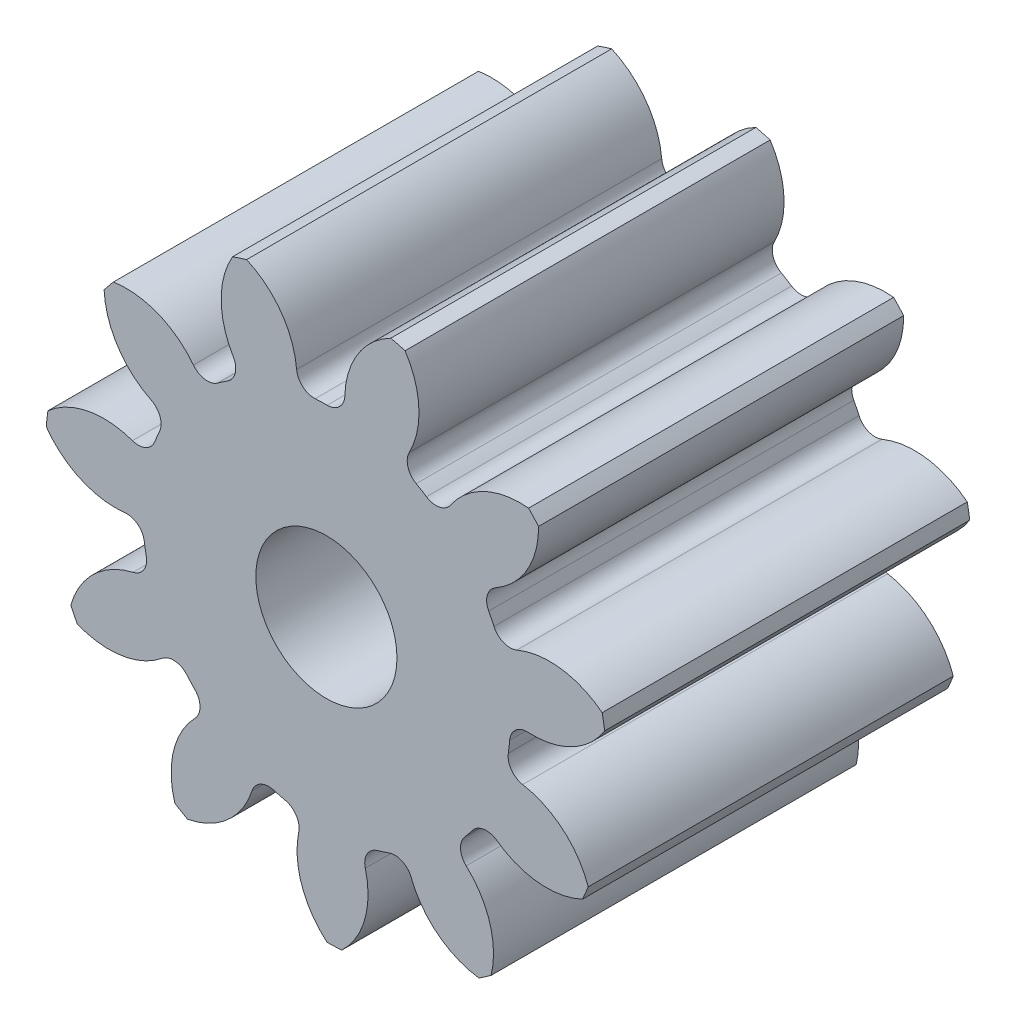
ISO-10303-21;
HEADER;
FILE_DESCRIPTION(('STEP AP214'),'2;1');
FILE_NAME('part.step','',(''),(''),'','','');
FILE_SCHEMA(('AUTOMOTIVE_DESIGN { 1 0 10303 214 1 1 1 1 }'));
ENDSEC;
DATA;
#1=APPLICATION_CONTEXT('core data for automotive mechanical design processes');
#2=APPLICATION_PROTOCOL_DEFINITION('international standard','automotive_design',2000,#1);
#3=PRODUCT_CONTEXT('',#1,'mechanical');
#4=PRODUCT('Part','Part','',(#3));
#5=PRODUCT_RELATED_PRODUCT_CATEGORY('part','',(#4));
#6=PRODUCT_DEFINITION_FORMATION('','',#4);
#7=PRODUCT_DEFINITION_CONTEXT('part definition',#1,'design');
#8=PRODUCT_DEFINITION('design','',#6,#7);
#9=PRODUCT_DEFINITION_SHAPE('','',#8);
#10=(LENGTH_UNIT() NAMED_UNIT(*) SI_UNIT(.MILLI.,.METRE.));
#11=(NAMED_UNIT(*) PLANE_ANGLE_UNIT() SI_UNIT($,.RADIAN.));
#12=(NAMED_UNIT(*) SI_UNIT($,.STERADIAN.) SOLID_ANGLE_UNIT());
#13=UNCERTAINTY_MEASURE_WITH_UNIT(LENGTH_MEASURE(1.E-05),#10,'distance_accuracy_value','');
#14=(GEOMETRIC_REPRESENTATION_CONTEXT(3) GLOBAL_UNCERTAINTY_ASSIGNED_CONTEXT((#13)) GLOBAL_UNIT_ASSIGNED_CONTEXT((#10,
#11,#12)) REPRESENTATION_CONTEXT('',''));
#15=CARTESIAN_POINT('',(0.,0.,0.));
#16=DIRECTION('',(0.,0.,1.));
#17=DIRECTION('',(1.,0.,0.));
#18=AXIS2_PLACEMENT_3D('',#15,#16,#17);
#19=CARTESIAN_POINT('',(0.,0.,95.25));
#20=DIRECTION('',(0.,0.,-1.));
#21=DIRECTION('',(-1.,0.,0.));
#22=AXIS2_PLACEMENT_3D('',#19,#20,#21);
#23=CYLINDRICAL_SURFACE('',#22,73.3777777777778);
#24=DIRECTION('',(0.,0.,-1.));
#25=VECTOR('',#24,1.);
#26=CARTESIAN_POINT('',(71.9543427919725,14.3830047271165,47.625));
#27=LINE('',#26,#25);
#28=CARTESIAN_POINT('',(71.9543427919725,14.3830047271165,95.25));
#29=VERTEX_POINT('',#28);
#30=CARTESIAN_POINT('',(71.9543427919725,14.3830047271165,0.));
#31=VERTEX_POINT('',#30);
#32=EDGE_CURVE('E492',#29,#31,#27,.T.);
#33=ORIENTED_EDGE('',*,*,#32,.F.);
#34=CARTESIAN_POINT('',(0.,0.,95.25));
#35=DIRECTION('',(0.,0.,1.));
#36=DIRECTION('',(1.,0.,0.));
#37=AXIS2_PLACEMENT_3D('',#34,#35,#36);
#38=CIRCLE('',#37,73.3777777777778);
#39=CARTESIAN_POINT('',(72.6092992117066,10.5918808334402,95.25));
#40=VERTEX_POINT('',#39);
#41=EDGE_CURVE('E871',#40,#29,#38,.T.);
#42=ORIENTED_EDGE('',*,*,#41,.F.);
#43=DIRECTION('',(0.,0.,-1.));
#44=VECTOR('',#43,1.);
#45=CARTESIAN_POINT('',(72.6092992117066,10.5918808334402,47.625));
#46=LINE('',#45,#44);
#47=CARTESIAN_POINT('',(72.6092992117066,10.5918808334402,0.));
#48=VERTEX_POINT('',#47);
#49=EDGE_CURVE('E865',#48,#40,#46,.F.);
#50=ORIENTED_EDGE('',*,*,#49,.F.);
#51=CARTESIAN_POINT('',(0.,0.,0.));
#52=DIRECTION('',(0.,0.,1.));
#53=DIRECTION('',(1.,0.,0.));
#54=AXIS2_PLACEMENT_3D('',#51,#52,#53);
#55=CIRCLE('',#54,73.3777777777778);
#56=EDGE_CURVE('E876',#48,#31,#55,.T.);
#57=ORIENTED_EDGE('',*,*,#56,.T.);
#58=EDGE_LOOP('',(#33,#42,#50,#57));
#59=FACE_BOUND('',#58,.T.);
#60=ADVANCED_FACE('F33',(#59),#23,.T.);
#61=DIRECTION('',(0.,0.,-1.));
#62=VECTOR('',#61,1.);
#63=CARTESIAN_POINT('',(55.3564263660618,48.1660080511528,47.625));
#64=LINE('',#63,#62);
#65=CARTESIAN_POINT('',(55.3564263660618,48.1660080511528,0.));
#66=VERTEX_POINT('',#65);
#67=CARTESIAN_POINT('',(55.3564263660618,48.1660080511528,95.25));
#68=VERTEX_POINT('',#67);
#69=EDGE_CURVE('E463',#66,#68,#64,.F.);
#70=ORIENTED_EDGE('',*,*,#69,.F.);
#71=CARTESIAN_POINT('',(52.7558056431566,51.0012082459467,0.));
#72=VERTEX_POINT('',#71);
#73=EDGE_CURVE('E879',#66,#72,#55,.T.);
#74=ORIENTED_EDGE('',*,*,#73,.T.);
#75=DIRECTION('',(0.,0.,-1.));
#76=VECTOR('',#75,1.);
#77=CARTESIAN_POINT('',(52.7558056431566,51.0012082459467,47.625));
#78=LINE('',#77,#76);
#79=CARTESIAN_POINT('',(52.7558056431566,51.0012082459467,95.25));
#80=VERTEX_POINT('',#79);
#81=EDGE_CURVE('E525',#80,#72,#78,.T.);
#82=ORIENTED_EDGE('',*,*,#81,.F.);
#83=EDGE_CURVE('E874',#68,#80,#38,.T.);
#84=ORIENTED_EDGE('',*,*,#83,.F.);
#85=EDGE_LOOP('',(#70,#74,#82,#84));
#86=FACE_BOUND('',#85,.T.);
#87=ADVANCED_FACE('F1006',(#86),#23,.T.);
#88=CARTESIAN_POINT('',(0.,0.,95.25));
#89=DIRECTION('',(0.,0.,1.));
#90=DIRECTION('',(1.,0.,0.));
#91=AXIS2_PLACEMENT_3D('',#88,#89,#90);
#92=PLANE('',#91);
#93=CARTESIAN_POINT('',(0.,0.,95.2500000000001));
#94=DIRECTION('',(0.,0.,1.));
#95=DIRECTION('',(1.,0.,0.));
#96=AXIS2_PLACEMENT_3D('',#93,#94,#95);
#97=CIRCLE('',#96,18.415);
#98=CARTESIAN_POINT('',(18.415,0.,95.2499999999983));
#99=VERTEX_POINT('',#98);
#100=EDGE_CURVE('E480',#99,#99,#97,.T.);
#101=ORIENTED_EDGE('',*,*,#100,.F.);
#102=EDGE_LOOP('',(#101));
#103=FACE_BOUND('',#102,.T.);
#104=ORIENTED_EDGE('',*,*,#41,.T.);
#105=CARTESIAN_POINT('',(58.2699270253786,-2.94836704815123,95.25));
#106=DIRECTION('',(0.,0.,-1.));
#107=DIRECTION('',(0.841253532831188,0.540640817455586,0.));
#108=AXIS2_PLACEMENT_3D('',#105,#106,#107);
#109=CIRCLE('',#108,22.0825651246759);
#110=CARTESIAN_POINT('',(49.6972650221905,17.4022876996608,95.25));
#111=VERTEX_POINT('',#110);
#112=EDGE_CURVE('E472',#111,#29,#109,.T.);
#113=ORIENTED_EDGE('',*,*,#112,.F.);
#114=CARTESIAN_POINT('',(47.913606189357,21.6365179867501,95.25));
#115=DIRECTION('',(0.,0.,1.));
#116=DIRECTION('',(-0.841253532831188,-0.540640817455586,0.));
#117=AXIS2_PLACEMENT_3D('',#114,#115,#116);
#118=CIRCLE('',#117,4.59457777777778);
#119=CARTESIAN_POINT('',(43.726181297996,19.7455875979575,95.25));
#120=VERTEX_POINT('',#119);
#121=EDGE_CURVE('E470',#120,#111,#118,.T.);
#122=ORIENTED_EDGE('',*,*,#121,.F.);
#123=CARTESIAN_POINT('',(0.,0.,95.25));
#124=DIRECTION('',(0.,0.,-1.));
#125=DIRECTION('',(0.841253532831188,0.540640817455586,0.));
#126=AXIS2_PLACEMENT_3D('',#123,#124,#125);
#127=CIRCLE('',#126,47.9777777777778);
#128=CARTESIAN_POINT('',(42.350855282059,22.5448933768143,95.25));
#129=VERTEX_POINT('',#128);
#130=EDGE_CURVE('E455',#129,#120,#127,.T.);
#131=ORIENTED_EDGE('',*,*,#130,.F.);
#132=CARTESIAN_POINT('',(46.4065724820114,24.7038984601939,95.25));
#133=DIRECTION('',(0.,0.,1.));
#134=DIRECTION('',(-0.841253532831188,-0.540640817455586,0.));
#135=AXIS2_PLACEMENT_3D('',#132,#133,#134);
#136=CIRCLE('',#135,4.59457777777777);
#137=CARTESIAN_POINT('',(44.1449645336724,28.7033077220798,95.25));
#138=VERTEX_POINT('',#137);
#139=EDGE_CURVE('E447',#138,#129,#136,.T.);
#140=ORIENTED_EDGE('',*,*,#139,.F.);
#141=CARTESIAN_POINT('',(33.2751725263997,47.9253602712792,95.25));
#142=DIRECTION('',(0.,0.,-1.));
#143=DIRECTION('',(-0.841253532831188,-0.540640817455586,0.));
#144=AXIS2_PLACEMENT_3D('',#141,#142,#143);
#145=CIRCLE('',#144,22.0825651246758);
#146=EDGE_CURVE('E477',#68,#138,#145,.T.);
#147=ORIENTED_EDGE('',*,*,#146,.F.);
#148=ORIENTED_EDGE('',*,*,#83,.T.);
#149=CARTESIAN_POINT('',(50.6137895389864,29.0227767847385,95.25));
#150=DIRECTION('',(0.,0.,-1.));
#151=DIRECTION('',(0.415415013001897,0.909631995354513,0.));
#152=AXIS2_PLACEMENT_3D('',#149,#150,#151);
#153=CIRCLE('',#152,22.0825651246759);
#154=CARTESIAN_POINT('',(32.399612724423,41.5081059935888,95.25));
#155=VERTEX_POINT('',#154);
#156=EDGE_CURVE('E501',#155,#80,#153,.T.);
#157=ORIENTED_EDGE('',*,*,#156,.F.);
#158=CARTESIAN_POINT('',(28.6099057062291,44.1058484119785,95.25));
#159=DIRECTION('',(0.,0.,1.));
#160=DIRECTION('',(-0.415415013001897,-0.909631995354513,0.));
#161=AXIS2_PLACEMENT_3D('',#158,#159,#160);
#162=CIRCLE('',#161,4.59457777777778);
#163=CARTESIAN_POINT('',(26.1095338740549,40.2512037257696,95.25));
#164=VERTEX_POINT('',#163);
#165=EDGE_CURVE('E499',#164,#155,#162,.T.);
#166=ORIENTED_EDGE('',*,*,#165,.F.);
#167=CARTESIAN_POINT('',(0.,0.,95.25));
#168=DIRECTION('',(0.,0.,-1.));
#169=DIRECTION('',(0.415415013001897,0.909631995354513,0.));
#170=AXIS2_PLACEMENT_3D('',#167,#168,#169);
#171=CIRCLE('',#170,47.9777777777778);
#172=CARTESIAN_POINT('',(23.439117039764,41.8625722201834,95.25));
#173=VERTEX_POINT('',#172);
#174=EDGE_CURVE('E496',#173,#164,#171,.T.);
#175=ORIENTED_EDGE('',*,*,#174,.F.);
#176=CARTESIAN_POINT('',(25.683757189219,45.871529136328,95.25));
#177=DIRECTION('',(0.,0.,1.));
#178=DIRECTION('',(-0.415415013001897,-0.909631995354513,0.));
#179=AXIS2_PLACEMENT_3D('',#176,#177,#178);
#180=CIRCLE('',#179,4.59457777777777);
#181=CARTESIAN_POINT('',(21.6189276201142,48.0133287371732,95.25));
#182=VERTEX_POINT('',#181);
#183=EDGE_CURVE('E494',#182,#173,#180,.T.);
#184=ORIENTED_EDGE('',*,*,#183,.F.);
#185=CARTESIAN_POINT('',(2.08245048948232,58.3072951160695,95.25));
#186=DIRECTION('',(0.,0.,-1.));
#187=DIRECTION('',(-0.415415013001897,-0.909631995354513,0.));
#188=AXIS2_PLACEMENT_3D('',#185,#186,#187);
#189=CIRCLE('',#188,22.0825651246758);
#190=CARTESIAN_POINT('',(20.5282792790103,70.4477680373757,95.25));
#191=VERTEX_POINT('',#190);
#192=EDGE_CURVE('E504',#191,#182,#189,.T.);
#193=ORIENTED_EDGE('',*,*,#192,.F.);
#194=CARTESIAN_POINT('',(16.8076729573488,71.4268885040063,95.25));
#195=VERTEX_POINT('',#194);
#196=EDGE_CURVE('E909',#191,#195,#38,.T.);
#197=ORIENTED_EDGE('',*,*,#196,.T.);
#198=CARTESIAN_POINT('',(26.8881314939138,51.7793940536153,95.25));
#199=DIRECTION('',(0.,0.,-1.));
#200=DIRECTION('',(-0.142314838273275,0.989821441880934,0.));
#201=AXIS2_PLACEMENT_3D('',#198,#199,#200);
#202=CIRCLE('',#201,22.0825651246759);
#203=CARTESIAN_POINT('',(4.81531231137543,52.4353939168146,95.25));
#204=VERTEX_POINT('',#203);
#205=EDGE_CURVE('E536',#204,#195,#202,.T.);
#206=ORIENTED_EDGE('',*,*,#205,.F.);
#207=CARTESIAN_POINT('',(0.222762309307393,52.5718836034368,95.25));
#208=DIRECTION('',(0.,0.,1.));
#209=DIRECTION('',(0.142314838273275,-0.989821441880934,0.));
#210=AXIS2_PLACEMENT_3D('',#207,#208,#209);
#211=CIRCLE('',#210,4.59457777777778);
#212=CARTESIAN_POINT('',(0.203293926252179,47.9773470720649,95.25));
#213=VERTEX_POINT('',#212);
#214=EDGE_CURVE('E534',#213,#204,#211,.T.);
#215=ORIENTED_EDGE('',*,*,#214,.F.);
#216=CARTESIAN_POINT('',(0.,0.,95.25));
#217=DIRECTION('',(0.,0.,-1.));
#218=DIRECTION('',(-0.142314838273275,0.989821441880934,0.));
#219=AXIS2_PLACEMENT_3D('',#216,#217,#218);
#220=CIRCLE('',#219,47.9777777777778);
#221=CARTESIAN_POINT('',(-2.91437524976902,47.8891801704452,95.25));
#222=VERTEX_POINT('',#221);
#223=EDGE_CURVE('E531',#222,#213,#220,.T.);
#224=ORIENTED_EDGE('',*,*,#223,.F.);
#225=CARTESIAN_POINT('',(-3.19346953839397,52.4752734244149,95.25));
#226=DIRECTION('',(0.,0.,1.));
#227=DIRECTION('',(0.142314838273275,-0.989821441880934,0.));
#228=AXIS2_PLACEMENT_3D('',#225,#226,#227);
#229=CIRCLE('',#228,4.59457777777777);
#230=CARTESIAN_POINT('',(-7.77096606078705,52.0794571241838,95.25));
#231=VERTEX_POINT('',#230);
#232=EDGE_CURVE('E529',#231,#222,#229,.T.);
#233=ORIENTED_EDGE('',*,*,#232,.F.);
#234=CARTESIAN_POINT('',(-29.7714348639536,50.1770757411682,95.25));
#235=DIRECTION('',(0.,0.,-1.));
#236=DIRECTION('',(0.142314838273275,-0.989821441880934,0.));
#237=AXIS2_PLACEMENT_3D('',#234,#235,#236);
#238=CIRCLE('',#237,22.0825651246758);
#239=CARTESIAN_POINT('',(-20.8174514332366,70.3628594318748,95.25));
#240=VERTEX_POINT('',#239);
#241=EDGE_CURVE('E539',#240,#231,#238,.T.);
#242=ORIENTED_EDGE('',*,*,#241,.F.);
#243=CARTESIAN_POINT('',(-24.4767771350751,69.1750363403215,95.25));
#244=VERTEX_POINT('',#243);
#245=EDGE_CURVE('E988',#240,#244,#38,.T.);
#246=ORIENTED_EDGE('',*,*,#245,.T.);
#247=CARTESIAN_POINT('',(-5.37431831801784,58.0964195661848,95.25));
#248=DIRECTION('',(0.,0.,-1.));
#249=DIRECTION('',(-0.654860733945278,0.755749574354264,0.));
#250=AXIS2_PLACEMENT_3D('',#247,#248,#249);
#251=CIRCLE('',#250,22.0825651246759);
#252=CARTESIAN_POINT('',(-24.2978157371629,46.7148147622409,95.25));
#253=VERTEX_POINT('',#252);
#254=EDGE_CURVE('E574',#253,#244,#251,.T.);
#255=ORIENTED_EDGE('',*,*,#254,.F.);
#256=CARTESIAN_POINT('',(-28.2351065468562,44.346717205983,95.25));
#257=DIRECTION('',(0.,0.,1.));
#258=DIRECTION('',(0.654860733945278,-0.755749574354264,0.));
#259=AXIS2_PLACEMENT_3D('',#256,#257,#258);
#260=CIRCLE('',#259,4.59457777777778);
#261=CARTESIAN_POINT('',(-25.7674904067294,40.471021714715,95.25));
#262=VERTEX_POINT('',#261);
#263=EDGE_CURVE('E572',#262,#253,#260,.T.);
#264=ORIENTED_EDGE('',*,*,#263,.F.);
#265=CARTESIAN_POINT('',(0.,0.,95.25));
#266=DIRECTION('',(0.,0.,-1.));
#267=DIRECTION('',(-0.654860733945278,0.755749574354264,0.));
#268=AXIS2_PLACEMENT_3D('',#265,#266,#267);
#269=CIRCLE('',#268,47.9777777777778);
#270=CARTESIAN_POINT('',(-28.3425739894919,38.7113117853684,95.25));
#271=VERTEX_POINT('',#270);
#272=EDGE_CURVE('E569',#271,#262,#269,.T.);
#273=ORIENTED_EDGE('',*,*,#272,.F.);
#274=CARTESIAN_POINT('',(-31.0567922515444,42.4184891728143,95.25));
#275=DIRECTION('',(0.,0.,1.));
#276=DIRECTION('',(0.654860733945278,-0.755749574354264,0.));
#277=AXIS2_PLACEMENT_3D('',#274,#275,#276);
#278=CIRCLE('',#277,4.59457777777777);
#279=CARTESIAN_POINT('',(-34.6936329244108,39.610725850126,95.25));
#280=VERTEX_POINT('',#279);
#281=EDGE_CURVE('E567',#280,#271,#278,.T.);
#282=ORIENTED_EDGE('',*,*,#281,.F.);
#283=CARTESIAN_POINT('',(-52.173100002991,26.1159893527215,95.25));
#284=DIRECTION('',(0.,0.,-1.));
#285=DIRECTION('',(0.654860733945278,-0.755749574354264,0.));
#286=AXIS2_PLACEMENT_3D('',#283,#284,#285);
#287=CIRCLE('',#286,22.0825651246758);
#288=CARTESIAN_POINT('',(-55.553788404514,47.9382401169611,95.25));
#289=VERTEX_POINT('',#288);
#290=EDGE_CURVE('E577',#289,#280,#287,.T.);
#291=ORIENTED_EDGE('',*,*,#290,.F.);
#292=CARTESIAN_POINT('',(-57.9900234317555,44.9605989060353,95.25));
#293=VERTEX_POINT('',#292);
#294=EDGE_CURVE('E984',#289,#293,#38,.T.);
#295=ORIENTED_EDGE('',*,*,#294,.T.);
#296=CARTESIAN_POINT('',(-35.9304600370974,45.9682423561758,95.25));
#297=DIRECTION('',(0.,0.,-1.));
#298=DIRECTION('',(-0.959492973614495,0.281732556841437,0.));
#299=AXIS2_PLACEMENT_3D('',#296,#297,#298);
#300=CIRCLE('',#299,22.0825651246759);
#301=CARTESIAN_POINT('',(-45.6965589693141,26.1626119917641,95.25));
#302=VERTEX_POINT('',#301);
#303=EDGE_CURVE('E612',#302,#293,#300,.T.);
#304=ORIENTED_EDGE('',*,*,#303,.F.);
#305=CARTESIAN_POINT('',(-47.7285285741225,22.0417814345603,95.25));
#306=DIRECTION('',(0.,0.,1.));
#307=DIRECTION('',(0.959492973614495,-0.281732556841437,0.));
#308=AXIS2_PLACEMENT_3D('',#305,#306,#307);
#309=CIRCLE('',#308,4.59457777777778);
#310=CARTESIAN_POINT('',(-43.5572785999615,20.115432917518,95.25));
#311=VERTEX_POINT('',#310);
#312=EDGE_CURVE('E610',#311,#302,#309,.T.);
#313=ORIENTED_EDGE('',*,*,#312,.F.);
#314=CARTESIAN_POINT('',(0.,0.,95.25));
#315=DIRECTION('',(0.,0.,-1.));
#316=DIRECTION('',(-0.959492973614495,0.281732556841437,0.));
#317=AXIS2_PLACEMENT_3D('',#314,#315,#316);
#318=CIRCLE('',#317,47.9777777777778);
#319=CARTESIAN_POINT('',(-44.7722057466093,17.2428754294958,95.25));
#320=VERTEX_POINT('',#319);
#321=EDGE_CURVE('E607',#320,#311,#318,.T.);
#322=ORIENTED_EDGE('',*,*,#321,.F.);
#323=CARTESIAN_POINT('',(-49.0598028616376,18.8941343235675,95.25));
#324=DIRECTION('',(0.,0.,1.));
#325=DIRECTION('',(0.959492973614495,-0.281732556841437,0.));
#326=AXIS2_PLACEMENT_3D('',#323,#324,#325);
#327=CIRCLE('',#326,4.59457777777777);
#328=CARTESIAN_POINT('',(-50.6013164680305,14.5658689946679,95.25));
#329=VERTEX_POINT('',#328);
#330=EDGE_CURVE('E605',#329,#320,#327,.T.);
#331=ORIENTED_EDGE('',*,*,#330,.F.);
#332=CARTESIAN_POINT('',(-58.0101745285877,-6.23673912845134,95.25));
#333=DIRECTION('',(0.,0.,-1.));
#334=DIRECTION('',(0.959492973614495,-0.281732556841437,0.));
#335=AXIS2_PLACEMENT_3D('',#332,#333,#334);
#336=CIRCLE('',#335,22.0825651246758);
#337=CARTESIAN_POINT('',(-72.6521900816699,10.2935682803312,95.25));
#338=VERTEX_POINT('',#337);
#339=EDGE_CURVE('E615',#338,#329,#336,.T.);
#340=ORIENTED_EDGE('',*,*,#339,.F.);
#341=CARTESIAN_POINT('',(-73.0918470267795,6.47148899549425,95.25));
#342=VERTEX_POINT('',#341);
#343=EDGE_CURVE('E980',#338,#342,#38,.T.);
#344=ORIENTED_EDGE('',*,*,#343,.T.);
#345=CARTESIAN_POINT('',(-55.0789345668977,19.2454729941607,95.25));
#346=DIRECTION('',(0.,0.,-1.));
#347=DIRECTION('',(-0.959492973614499,-0.281732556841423,0.));
#348=AXIS2_PLACEMENT_3D('',#345,#346,#347);
#349=CIRCLE('',#348,22.0825651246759);
#350=CARTESIAN_POINT('',(-52.5869676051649,-2.69603522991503,95.25));
#351=VERTEX_POINT('',#350);
#352=EDGE_CURVE('E650',#351,#342,#349,.T.);
#353=ORIENTED_EDGE('',*,*,#352,.F.);
#354=CARTESIAN_POINT('',(-52.0684800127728,-7.26126420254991,95.25));
#355=DIRECTION('',(0.,0.,1.));
#356=DIRECTION('',(0.959492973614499,0.281732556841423,0.));
#357=AXIS2_PLACEMENT_3D('',#354,#355,#356);
#358=CIRCLE('',#357,4.59457777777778);
#359=CARTESIAN_POINT('',(-47.5179385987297,-6.6266637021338,95.25));
#360=VERTEX_POINT('',#359);
#361=EDGE_CURVE('E648',#360,#351,#358,.T.);
#362=ORIENTED_EDGE('',*,*,#361,.F.);
#363=CARTESIAN_POINT('',(0.,0.,95.25));
#364=DIRECTION('',(0.,0.,-1.));
#365=DIRECTION('',(-0.959492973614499,-0.281732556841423,0.));
#366=AXIS2_PLACEMENT_3D('',#363,#364,#365);
#367=CIRCLE('',#366,47.9777777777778);
#368=CARTESIAN_POINT('',(-46.9869785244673,-9.70005204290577,95.25));
#369=VERTEX_POINT('',#368);
#370=EDGE_CURVE('E645',#369,#360,#367,.T.);
#371=ORIENTED_EDGE('',*,*,#370,.F.);
#372=CARTESIAN_POINT('',(-51.4866727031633,-10.6289746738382,95.25));
#373=DIRECTION('',(0.,0.,1.));
#374=DIRECTION('',(0.959492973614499,0.281732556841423,0.));
#375=AXIS2_PLACEMENT_3D('',#372,#373,#374);
#376=CIRCLE('',#375,4.59457777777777);
#377=CARTESIAN_POINT('',(-50.4434395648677,-15.1035483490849,95.25));
#378=VERTEX_POINT('',#377);
#379=EDGE_CURVE('E643',#378,#369,#376,.T.);
#380=ORIENTED_EDGE('',*,*,#379,.F.);
#381=CARTESIAN_POINT('',(-45.4294285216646,-36.6093470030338,95.25));
#382=DIRECTION('',(0.,0.,-1.));
#383=DIRECTION('',(0.959492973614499,0.281732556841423,0.));
#384=AXIS2_PLACEMENT_3D('',#381,#382,#383);
#385=CIRCLE('',#384,22.0825651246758);
#386=CARTESIAN_POINT('',(-66.6840347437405,-30.6192387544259,95.25));
#387=VERTEX_POINT('',#386);
#388=EDGE_CURVE('E653',#387,#378,#385,.T.);
#389=ORIENTED_EDGE('',*,*,#388,.F.);
#390=CARTESIAN_POINT('',(-64.9875256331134,-34.07227294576,95.25));
#391=VERTEX_POINT('',#390);
#392=EDGE_CURVE('E976',#387,#391,#38,.T.);
#393=ORIENTED_EDGE('',*,*,#392,.T.);
#394=CARTESIAN_POINT('',(-56.7402365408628,-13.5875980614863,95.25));
#395=DIRECTION('',(0.,0.,-1.));
#396=DIRECTION('',(-0.654860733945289,-0.755749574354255,0.));
#397=AXIS2_PLACEMENT_3D('',#394,#395,#396);
#398=CIRCLE('',#397,22.0825651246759);
#399=CARTESIAN_POINT('',(-42.7813855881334,-30.6987103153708,95.25));
#400=VERTEX_POINT('',#399);
#401=EDGE_CURVE('E688',#400,#391,#398,.T.);
#402=ORIENTED_EDGE('',*,*,#401,.F.);
#403=CARTESIAN_POINT('',(-39.8770569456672,-34.2589097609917,95.25));
#404=DIRECTION('',(0.,0.,1.));
#405=DIRECTION('',(0.654860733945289,0.755749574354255,0.));
#406=AXIS2_PLACEMENT_3D('',#403,#404,#405);
#407=CIRCLE('',#406,4.59457777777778);
#408=CARTESIAN_POINT('',(-36.3919888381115,-31.2648414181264,95.25));
#409=VERTEX_POINT('',#408);
#410=EDGE_CURVE('E686',#409,#400,#407,.T.);
#411=ORIENTED_EDGE('',*,*,#410,.F.);
#412=CARTESIAN_POINT('',(0.,0.,95.25));
#413=DIRECTION('',(0.,0.,-1.));
#414=DIRECTION('',(-0.654860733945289,-0.755749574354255,0.));
#415=AXIS2_PLACEMENT_3D('',#412,#413,#414);
#416=CIRCLE('',#415,47.9777777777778);
#417=CARTESIAN_POINT('',(-34.2837176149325,-33.5632815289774,95.25));
#418=VERTEX_POINT('',#417);
#419=EDGE_CURVE('E683',#418,#409,#416,.T.);
#420=ORIENTED_EDGE('',*,*,#419,.F.);
#421=CARTESIAN_POINT('',(-37.5668877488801,-36.7774593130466,95.25));
#422=DIRECTION('',(0.,0.,1.));
#423=DIRECTION('',(0.654860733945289,0.755749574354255,0.));
#424=AXIS2_PLACEMENT_3D('',#421,#422,#423);
#425=CIRCLE('',#424,4.59457777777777);
#426=CARTESIAN_POINT('',(-34.2701270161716,-39.9776958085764,95.25));
#427=VERTEX_POINT('',#426);
#428=EDGE_CURVE('E681',#427,#418,#425,.T.);
#429=ORIENTED_EDGE('',*,*,#428,.F.);
#430=CARTESIAN_POINT('',(-18.4251599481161,-55.3587458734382,95.25));
#431=DIRECTION('',(0.,0.,-1.));
#432=DIRECTION('',(0.654860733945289,0.755749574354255,0.));
#433=AXIS2_PLACEMENT_3D('',#430,#431,#432);
#434=CIRCLE('',#433,22.0825651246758);
#435=CARTESIAN_POINT('',(-39.5441695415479,-61.8106538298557,95.25));
#436=VERTEX_POINT('',#435);
#437=EDGE_CURVE('E691',#436,#427,#434,.T.);
#438=ORIENTED_EDGE('',*,*,#437,.F.);
#439=CARTESIAN_POINT('',(-36.2501240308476,-63.7983289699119,95.25));
#440=VERTEX_POINT('',#439);
#441=EDGE_CURVE('E972',#436,#440,#38,.T.);
#442=ORIENTED_EDGE('',*,*,#441,.T.);
#443=CARTESIAN_POINT('',(-40.3869143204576,-42.1067027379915,95.25));
#444=DIRECTION('',(0.,0.,-1.));
#445=DIRECTION('',(-0.142314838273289,-0.989821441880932,0.));
#446=AXIS2_PLACEMENT_3D('',#443,#444,#445);
#447=CIRCLE('',#446,22.0825651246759);
#448=CARTESIAN_POINT('',(-19.3930159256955,-48.9547617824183,95.25));
#449=VERTEX_POINT('',#448);
#450=EDGE_CURVE('E726',#449,#440,#447,.T.);
#451=ORIENTED_EDGE('',*,*,#450,.F.);
#452=CARTESIAN_POINT('',(-15.0249500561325,-50.3795935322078,95.25));
#453=DIRECTION('',(0.,0.,1.));
#454=DIRECTION('',(0.142314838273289,0.989821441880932,0.));
#455=AXIS2_PLACEMENT_3D('',#452,#453,#454);
#456=CIRCLE('',#455,4.59457777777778);
#457=CARTESIAN_POINT('',(-13.7118397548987,-45.9766528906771,95.25));
#458=VERTEX_POINT('',#457);
#459=EDGE_CURVE('E724',#458,#449,#456,.T.);
#460=ORIENTED_EDGE('',*,*,#459,.F.);
#461=CARTESIAN_POINT('',(0.,0.,95.25));
#462=DIRECTION('',(0.,0.,-1.));
#463=DIRECTION('',(-0.142314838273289,-0.989821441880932,0.));
#464=AXIS2_PLACEMENT_3D('',#461,#462,#463);
#465=CIRCLE('',#464,47.9777777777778);
#466=CARTESIAN_POINT('',(-10.6956185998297,-46.7704062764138,95.25));
#467=VERTEX_POINT('',#466);
#468=EDGE_CURVE('E721',#467,#458,#465,.T.);
#469=ORIENTED_EDGE('',*,*,#468,.F.);
#470=CARTESIAN_POINT('',(-11.7198813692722,-51.2493604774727,95.25));
#471=DIRECTION('',(0.,0.,1.));
#472=DIRECTION('',(0.142314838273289,0.989821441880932,0.));
#473=AXIS2_PLACEMENT_3D('',#470,#471,#472);
#474=CIRCLE('',#473,4.59457777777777);
#475=CARTESIAN_POINT('',(-7.21629128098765,-52.1592073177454,95.25));
#476=VERTEX_POINT('',#475);
#477=EDGE_CURVE('E719',#476,#467,#474,.T.);
#478=ORIENTED_EDGE('',*,*,#477,.F.);
#479=CARTESIAN_POINT('',(14.4289667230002,-56.532134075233,95.25));
#480=DIRECTION('',(0.,0.,-1.));
#481=DIRECTION('',(0.142314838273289,0.989821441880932,0.));
#482=AXIS2_PLACEMENT_3D('',#479,#480,#481);
#483=CIRCLE('',#482,22.0825651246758);
#484=CARTESIAN_POINT('',(0.150690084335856,-73.3776230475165,95.25));
#485=VERTEX_POINT('',#484);
#486=EDGE_CURVE('E729',#485,#476,#483,.T.);
#487=ORIENTED_EDGE('',*,*,#486,.F.);
#488=CARTESIAN_POINT('',(3.99643582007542,-73.2688663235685,95.25));
#489=VERTEX_POINT('',#488);
#490=EDGE_CURVE('E968',#485,#489,#38,.T.);
#491=ORIENTED_EDGE('',*,*,#490,.T.);
#492=CARTESIAN_POINT('',(-11.2110321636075,-57.2572268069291,95.25));
#493=DIRECTION('',(0.,0.,-1.));
#494=DIRECTION('',(0.415415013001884,-0.909631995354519,0.));
#495=AXIS2_PLACEMENT_3D('',#492,#493,#494);
#496=CIRCLE('',#495,22.0825651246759);
#497=CARTESIAN_POINT('',(10.152499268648,-51.6680222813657,95.25));
#498=VERTEX_POINT('',#497);
#499=EDGE_CURVE('E764',#498,#489,#496,.T.);
#500=ORIENTED_EDGE('',*,*,#499,.F.);
#501=CARTESIAN_POINT('',(14.5974723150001,-50.5051123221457,95.25));
#502=DIRECTION('',(0.,0.,1.));
#503=DIRECTION('',(-0.415415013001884,0.909631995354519,0.));
#504=AXIS2_PLACEMENT_3D('',#501,#502,#503);
#505=CIRCLE('',#504,4.59457777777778);
#506=CARTESIAN_POINT('',(13.3217215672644,-46.0912019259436,95.25));
#507=VERTEX_POINT('',#506);
#508=EDGE_CURVE('E762',#507,#498,#505,.T.);
#509=ORIENTED_EDGE('',*,*,#508,.F.);
#510=CARTESIAN_POINT('',(0.,0.,95.25));
#511=DIRECTION('',(0.,0.,-1.));
#512=DIRECTION('',(0.415415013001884,-0.909631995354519,0.));
#513=AXIS2_PLACEMENT_3D('',#510,#511,#512);
#514=CIRCLE('',#513,47.9777777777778);
#515=CARTESIAN_POINT('',(16.2882637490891,-45.1282574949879,95.25));
#516=VERTEX_POINT('',#515);
#517=EDGE_CURVE('E759',#516,#507,#514,.T.);
#518=ORIENTED_EDGE('',*,*,#517,.F.);
#519=CARTESIAN_POINT('',(17.8481045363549,-49.4499518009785,95.25));
#520=DIRECTION('',(0.,0.,1.));
#521=DIRECTION('',(-0.415415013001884,0.909631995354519,0.));
#522=AXIS2_PLACEMENT_3D('',#519,#520,#521);
#523=CIRCLE('',#522,4.59457777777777);
#524=CARTESIAN_POINT('',(22.1286659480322,-47.7805390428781,95.25));
#525=VERTEX_POINT('',#524);
#526=EDGE_CURVE('E757',#525,#516,#523,.T.);
#527=ORIENTED_EDGE('',*,*,#526,.F.);
#528=CARTESIAN_POINT('',(42.7019984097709,-39.7569691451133,95.25));
#529=DIRECTION('',(0.,0.,-1.));
#530=DIRECTION('',(-0.415415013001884,0.909631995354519,0.));
#531=AXIS2_PLACEMENT_3D('',#528,#529,#530);
#532=CIRCLE('',#531,22.0825651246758);
#533=CARTESIAN_POINT('',(39.7977066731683,-61.6477154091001,95.25));
#534=VERTEX_POINT('',#533);
#535=EDGE_CURVE('E767',#534,#525,#532,.T.);
#536=ORIENTED_EDGE('',*,*,#535,.F.);
#537=CARTESIAN_POINT('',(42.9741555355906,-59.4770563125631,95.25));
#538=VERTEX_POINT('',#537);
#539=EDGE_CURVE('E967',#534,#538,#38,.T.);
#540=ORIENTED_EDGE('',*,*,#539,.T.);
#541=CARTESIAN_POINT('',(21.52427349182,-54.2289859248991,95.25));
#542=DIRECTION('',(0.,0.,-1.));
#543=DIRECTION('',(0.841253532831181,-0.540640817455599,0.));
#544=AXIS2_PLACEMENT_3D('',#541,#542,#543);
#545=CIRCLE('',#544,22.0825651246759);
#546=CARTESIAN_POINT('',(36.4746676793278,-37.9770507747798,95.25));
#547=VERTEX_POINT('',#546);
#548=EDGE_CURVE('E802',#547,#538,#545,.T.);
#549=ORIENTED_EDGE('',*,*,#548,.F.);
#550=CARTESIAN_POINT('',(39.5853003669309,-34.5956148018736,95.25));
#551=DIRECTION('',(0.,0.,1.));
#552=DIRECTION('',(-0.841253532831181,0.540640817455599,0.));
#553=AXIS2_PLACEMENT_3D('',#550,#551,#552);
#554=CIRCLE('',#553,4.59457777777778);
#555=CARTESIAN_POINT('',(36.1257304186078,-31.5721200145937,95.25));
#556=VERTEX_POINT('',#555);
#557=EDGE_CURVE('E800',#556,#547,#554,.T.);
#558=ORIENTED_EDGE('',*,*,#557,.F.);
#559=CARTESIAN_POINT('',(0.,0.,95.25));
#560=DIRECTION('',(0.,0.,-1.));
#561=DIRECTION('',(0.841253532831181,-0.540640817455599,0.));
#562=AXIS2_PLACEMENT_3D('',#559,#560,#561);
#563=CIRCLE('',#562,47.9777777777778);
#564=CARTESIAN_POINT('',(38.1007374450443,-29.1582058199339,95.25));
#565=VERTEX_POINT('',#564);
#566=EDGE_CURVE('E797',#565,#556,#563,.T.);
#567=ORIENTED_EDGE('',*,*,#566,.F.);
#568=CARTESIAN_POINT('',(41.7494433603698,-31.9505328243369,95.25));
#569=DIRECTION('',(0.,0.,1.));
#570=DIRECTION('',(-0.841253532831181,0.540640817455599,0.));
#571=AXIS2_PLACEMENT_3D('',#568,#569,#570);
#572=CIRCLE('',#571,4.59457777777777);
#573=CARTESIAN_POINT('',(44.4479280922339,-28.2318872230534,95.25));
#574=VERTEX_POINT('',#573);
#575=EDGE_CURVE('E795',#574,#565,#572,.T.);
#576=ORIENTED_EDGE('',*,*,#575,.F.);
#577=CARTESIAN_POINT('',(57.4174473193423,-10.3592474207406,95.25));
#578=DIRECTION('',(0.,0.,-1.));
#579=DIRECTION('',(-0.841253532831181,0.540640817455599,0.));
#580=AXIS2_PLACEMENT_3D('',#577,#578,#579);
#581=CIRCLE('',#580,22.0825651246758);
#582=CARTESIAN_POINT('',(66.8092325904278,-30.3450937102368,95.25));
#583=VERTEX_POINT('',#582);
#584=EDGE_CURVE('E805',#583,#574,#581,.T.);
#585=ORIENTED_EDGE('',*,*,#584,.F.);
#586=CARTESIAN_POINT('',(68.307884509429,-26.8017011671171,95.25));
#587=VERTEX_POINT('',#586);
#588=EDGE_CURVE('E875',#583,#587,#38,.T.);
#589=ORIENTED_EDGE('',*,*,#588,.T.);
#590=CARTESIAN_POINT('',(47.4257743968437,-33.9834251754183,95.25));
#591=DIRECTION('',(0.,0.,-1.));
#592=DIRECTION('',(1.,0.,0.));
#593=AXIS2_PLACEMENT_3D('',#590,#591,#592);
#594=CIRCLE('',#593,22.0825651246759);
#595=CARTESIAN_POINT('',(51.2163868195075,-12.2286339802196,95.25));
#596=VERTEX_POINT('',#595);
#597=EDGE_CURVE('E840',#596,#587,#594,.T.);
#598=ORIENTED_EDGE('',*,*,#597,.F.);
#599=CARTESIAN_POINT('',(52.005075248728,-7.7022540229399,95.25));
#600=DIRECTION('',(0.,0.,1.));
#601=DIRECTION('',(-1.,0.,0.));
#602=AXIS2_PLACEMENT_3D('',#599,#600,#601);
#603=CIRCLE('',#602,4.59457777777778);
#604=CARTESIAN_POINT('',(47.4600751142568,-7.02911307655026,95.25));
#605=VERTEX_POINT('',#604);
#606=EDGE_CURVE('E838',#605,#596,#603,.T.);
#607=ORIENTED_EDGE('',*,*,#606,.F.);
#608=CARTESIAN_POINT('',(0.,0.,95.25));
#609=DIRECTION('',(0.,0.,-1.));
#610=DIRECTION('',(1.,0.,0.));
#611=AXIS2_PLACEMENT_3D('',#608,#609,#610);
#612=CIRCLE('',#611,47.9777777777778);
#613=CARTESIAN_POINT('',(47.8164962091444,-3.93062981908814,95.25));
#614=VERTEX_POINT('',#613);
#615=EDGE_CURVE('E835',#614,#605,#612,.T.);
#616=ORIENTED_EDGE('',*,*,#615,.F.);
#617=CARTESIAN_POINT('',(52.3956289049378,-4.30704542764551,95.25));
#618=DIRECTION('',(0.,0.,1.));
#619=DIRECTION('',(-1.,0.,0.));
#620=AXIS2_PLACEMENT_3D('',#617,#618,#619);
#621=CIRCLE('',#620,4.59457777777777);
#622=CARTESIAN_POINT('',(52.6552871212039,0.280189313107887,95.25));
#623=VERTEX_POINT('',#622);
#624=EDGE_CURVE('E833',#623,#614,#621,.T.);
#625=ORIENTED_EDGE('',*,*,#624,.F.);
#626=CARTESIAN_POINT('',(53.9032623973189,22.3274621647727,95.25));
#627=DIRECTION('',(0.,0.,-1.));
#628=DIRECTION('',(-1.,0.,0.));
#629=AXIS2_PLACEMENT_3D('',#626,#627,#628);
#630=CIRCLE('',#629,22.0825651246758);
#631=EDGE_CURVE('E843',#40,#623,#630,.T.);
#632=ORIENTED_EDGE('',*,*,#631,.F.);
#633=EDGE_LOOP('',(#104,#113,#122,#131,#140,#147,#148,#157,#166,#175,#184,#193,#197,#206,#215,
#224,#233,#242,#246,#255,#264,#273,#282,#291,#295,#304,#313,#322,#331,#340,#344,#353,#362,#371,
#380,#389,#393,#402,#411,#420,#429,#438,#442,#451,#460,#469,#478,#487,#491,#500,#509,#518,#527,
#536,#540,#549,#558,#567,#576,#585,#589,#598,#607,#616,#625,#632));
#634=FACE_BOUND('',#633,.T.);
#635=ADVANCED_FACE('F468',(#103,#634),#92,.T.);
#636=CARTESIAN_POINT('',(0.,0.,0.));
#637=DIRECTION('',(0.,0.,1.));
#638=DIRECTION('',(1.,0.,0.));
#639=AXIS2_PLACEMENT_3D('',#636,#637,#638);
#640=PLANE('',#639);
#641=CARTESIAN_POINT('',(0.,0.,0.));
#642=DIRECTION('',(0.,0.,1.));
#643=DIRECTION('',(1.,0.,0.));
#644=AXIS2_PLACEMENT_3D('',#641,#642,#643);
#645=CIRCLE('',#644,18.415);
#646=CARTESIAN_POINT('',(18.415,0.,-1.77635683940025E-12));
#647=VERTEX_POINT('',#646);
#648=EDGE_CURVE('E36',#647,#647,#645,.T.);
#649=ORIENTED_EDGE('',*,*,#648,.T.);
#650=EDGE_LOOP('',(#649));
#651=FACE_BOUND('',#650,.T.);
#652=CARTESIAN_POINT('',(58.2699270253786,-2.94836704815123,0.));
#653=DIRECTION('',(0.,0.,-1.));
#654=DIRECTION('',(0.841253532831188,0.540640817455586,0.));
#655=AXIS2_PLACEMENT_3D('',#652,#653,#654);
#656=CIRCLE('',#655,22.0825651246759);
#657=CARTESIAN_POINT('',(49.6972650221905,17.4022876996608,0.));
#658=VERTEX_POINT('',#657);
#659=EDGE_CURVE('E456',#658,#31,#656,.T.);
#660=ORIENTED_EDGE('',*,*,#659,.T.);
#661=ORIENTED_EDGE('',*,*,#56,.F.);
#662=CARTESIAN_POINT('',(53.9032623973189,22.3274621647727,0.));
#663=DIRECTION('',(0.,0.,1.));
#664=DIRECTION('',(1.,0.,0.));
#665=AXIS2_PLACEMENT_3D('',#662,#663,#664);
#666=CIRCLE('',#665,22.0825651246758);
#667=CARTESIAN_POINT('',(52.6552871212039,0.280189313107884,0.));
#668=VERTEX_POINT('',#667);
#669=EDGE_CURVE('E873',#668,#48,#666,.T.);
#670=ORIENTED_EDGE('',*,*,#669,.F.);
#671=CARTESIAN_POINT('',(52.3956289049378,-4.30704542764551,0.));
#672=DIRECTION('',(0.,0.,1.));
#673=DIRECTION('',(-1.,0.,0.));
#674=AXIS2_PLACEMENT_3D('',#671,#672,#673);
#675=CIRCLE('',#674,4.59457777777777);
#676=CARTESIAN_POINT('',(47.8164962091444,-3.93062981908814,0.));
#677=VERTEX_POINT('',#676);
#678=EDGE_CURVE('E832',#668,#677,#675,.T.);
#679=ORIENTED_EDGE('',*,*,#678,.T.);
#680=CARTESIAN_POINT('',(0.,0.,0.));
#681=DIRECTION('',(0.,0.,-1.));
#682=DIRECTION('',(1.,0.,0.));
#683=AXIS2_PLACEMENT_3D('',#680,#681,#682);
#684=CIRCLE('',#683,47.9777777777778);
#685=CARTESIAN_POINT('',(47.4600751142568,-7.02911307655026,0.));
#686=VERTEX_POINT('',#685);
#687=EDGE_CURVE('E848',#677,#686,#684,.T.);
#688=ORIENTED_EDGE('',*,*,#687,.T.);
#689=CARTESIAN_POINT('',(52.005075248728,-7.7022540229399,0.));
#690=DIRECTION('',(0.,0.,1.));
#691=DIRECTION('',(-1.,0.,0.));
#692=AXIS2_PLACEMENT_3D('',#689,#690,#691);
#693=CIRCLE('',#692,4.59457777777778);
#694=CARTESIAN_POINT('',(51.2163868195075,-12.2286339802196,0.));
#695=VERTEX_POINT('',#694);
#696=EDGE_CURVE('E851',#686,#695,#693,.T.);
#697=ORIENTED_EDGE('',*,*,#696,.T.);
#698=CARTESIAN_POINT('',(47.4257743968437,-33.9834251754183,0.));
#699=DIRECTION('',(0.,0.,-1.));
#700=DIRECTION('',(1.,0.,0.));
#701=AXIS2_PLACEMENT_3D('',#698,#699,#700);
#702=CIRCLE('',#701,22.0825651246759);
#703=CARTESIAN_POINT('',(68.307884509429,-26.8017011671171,0.));
#704=VERTEX_POINT('',#703);
#705=EDGE_CURVE('E836',#695,#704,#702,.T.);
#706=ORIENTED_EDGE('',*,*,#705,.T.);
#707=CARTESIAN_POINT('',(66.8092325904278,-30.3450937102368,0.));
#708=VERTEX_POINT('',#707);
#709=EDGE_CURVE('E870',#708,#704,#55,.T.);
#710=ORIENTED_EDGE('',*,*,#709,.F.);
#711=CARTESIAN_POINT('',(57.4174473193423,-10.3592474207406,0.));
#712=DIRECTION('',(0.,0.,1.));
#713=DIRECTION('',(1.,0.,0.));
#714=AXIS2_PLACEMENT_3D('',#711,#712,#713);
#715=CIRCLE('',#714,22.0825651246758);
#716=CARTESIAN_POINT('',(44.4479280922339,-28.2318872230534,0.));
#717=VERTEX_POINT('',#716);
#718=EDGE_CURVE('E881',#717,#708,#715,.T.);
#719=ORIENTED_EDGE('',*,*,#718,.F.);
#720=CARTESIAN_POINT('',(41.7494433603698,-31.9505328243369,0.));
#721=DIRECTION('',(0.,0.,1.));
#722=DIRECTION('',(-0.841253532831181,0.540640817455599,0.));
#723=AXIS2_PLACEMENT_3D('',#720,#721,#722);
#724=CIRCLE('',#723,4.59457777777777);
#725=CARTESIAN_POINT('',(38.1007374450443,-29.1582058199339,0.));
#726=VERTEX_POINT('',#725);
#727=EDGE_CURVE('E794',#717,#726,#724,.T.);
#728=ORIENTED_EDGE('',*,*,#727,.T.);
#729=CARTESIAN_POINT('',(0.,0.,0.));
#730=DIRECTION('',(0.,0.,-1.));
#731=DIRECTION('',(0.841253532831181,-0.540640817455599,0.));
#732=AXIS2_PLACEMENT_3D('',#729,#730,#731);
#733=CIRCLE('',#732,47.9777777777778);
#734=CARTESIAN_POINT('',(36.1257304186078,-31.5721200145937,0.));
#735=VERTEX_POINT('',#734);
#736=EDGE_CURVE('E810',#726,#735,#733,.T.);
#737=ORIENTED_EDGE('',*,*,#736,.T.);
#738=CARTESIAN_POINT('',(39.5853003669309,-34.5956148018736,0.));
#739=DIRECTION('',(0.,0.,1.));
#740=DIRECTION('',(-0.841253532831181,0.540640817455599,0.));
#741=AXIS2_PLACEMENT_3D('',#738,#739,#740);
#742=CIRCLE('',#741,4.59457777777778);
#743=CARTESIAN_POINT('',(36.4746676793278,-37.9770507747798,0.));
#744=VERTEX_POINT('',#743);
#745=EDGE_CURVE('E813',#735,#744,#742,.T.);
#746=ORIENTED_EDGE('',*,*,#745,.T.);
#747=CARTESIAN_POINT('',(21.52427349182,-54.2289859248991,0.));
#748=DIRECTION('',(0.,0.,-1.));
#749=DIRECTION('',(0.841253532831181,-0.540640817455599,0.));
#750=AXIS2_PLACEMENT_3D('',#747,#748,#749);
#751=CIRCLE('',#750,22.0825651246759);
#752=CARTESIAN_POINT('',(42.9741555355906,-59.4770563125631,0.));
#753=VERTEX_POINT('',#752);
#754=EDGE_CURVE('E798',#744,#753,#751,.T.);
#755=ORIENTED_EDGE('',*,*,#754,.T.);
#756=CARTESIAN_POINT('',(39.7977066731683,-61.6477154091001,0.));
#757=VERTEX_POINT('',#756);
#758=EDGE_CURVE('E938',#757,#753,#55,.T.);
#759=ORIENTED_EDGE('',*,*,#758,.F.);
#760=CARTESIAN_POINT('',(42.7019984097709,-39.7569691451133,0.));
#761=DIRECTION('',(0.,0.,1.));
#762=DIRECTION('',(1.,0.,0.));
#763=AXIS2_PLACEMENT_3D('',#760,#761,#762);
#764=CIRCLE('',#763,22.0825651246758);
#765=CARTESIAN_POINT('',(22.1286659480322,-47.7805390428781,0.));
#766=VERTEX_POINT('',#765);
#767=EDGE_CURVE('E883',#766,#757,#764,.T.);
#768=ORIENTED_EDGE('',*,*,#767,.F.);
#769=CARTESIAN_POINT('',(17.8481045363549,-49.4499518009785,0.));
#770=DIRECTION('',(0.,0.,1.));
#771=DIRECTION('',(-0.415415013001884,0.909631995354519,0.));
#772=AXIS2_PLACEMENT_3D('',#769,#770,#771);
#773=CIRCLE('',#772,4.59457777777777);
#774=CARTESIAN_POINT('',(16.2882637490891,-45.1282574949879,0.));
#775=VERTEX_POINT('',#774);
#776=EDGE_CURVE('E756',#766,#775,#773,.T.);
#777=ORIENTED_EDGE('',*,*,#776,.T.);
#778=CARTESIAN_POINT('',(0.,0.,0.));
#779=DIRECTION('',(0.,0.,-1.));
#780=DIRECTION('',(0.415415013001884,-0.909631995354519,0.));
#781=AXIS2_PLACEMENT_3D('',#778,#779,#780);
#782=CIRCLE('',#781,47.9777777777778);
#783=CARTESIAN_POINT('',(13.3217215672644,-46.0912019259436,0.));
#784=VERTEX_POINT('',#783);
#785=EDGE_CURVE('E772',#775,#784,#782,.T.);
#786=ORIENTED_EDGE('',*,*,#785,.T.);
#787=CARTESIAN_POINT('',(14.5974723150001,-50.5051123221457,0.));
#788=DIRECTION('',(0.,0.,1.));
#789=DIRECTION('',(-0.415415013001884,0.909631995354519,0.));
#790=AXIS2_PLACEMENT_3D('',#787,#788,#789);
#791=CIRCLE('',#790,4.59457777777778);
#792=CARTESIAN_POINT('',(10.152499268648,-51.6680222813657,0.));
#793=VERTEX_POINT('',#792);
#794=EDGE_CURVE('E775',#784,#793,#791,.T.);
#795=ORIENTED_EDGE('',*,*,#794,.T.);
#796=CARTESIAN_POINT('',(-11.2110321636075,-57.2572268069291,0.));
#797=DIRECTION('',(0.,0.,-1.));
#798=DIRECTION('',(0.415415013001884,-0.909631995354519,0.));
#799=AXIS2_PLACEMENT_3D('',#796,#797,#798);
#800=CIRCLE('',#799,22.0825651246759);
#801=CARTESIAN_POINT('',(3.99643582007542,-73.2688663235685,0.));
#802=VERTEX_POINT('',#801);
#803=EDGE_CURVE('E760',#793,#802,#800,.T.);
#804=ORIENTED_EDGE('',*,*,#803,.T.);
#805=CARTESIAN_POINT('',(0.150690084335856,-73.3776230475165,0.));
#806=VERTEX_POINT('',#805);
#807=EDGE_CURVE('E933',#806,#802,#55,.T.);
#808=ORIENTED_EDGE('',*,*,#807,.F.);
#809=CARTESIAN_POINT('',(14.4289667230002,-56.532134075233,0.));
#810=DIRECTION('',(0.,0.,1.));
#811=DIRECTION('',(1.,0.,0.));
#812=AXIS2_PLACEMENT_3D('',#809,#810,#811);
#813=CIRCLE('',#812,22.0825651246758);
#814=CARTESIAN_POINT('',(-7.21629128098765,-52.1592073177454,0.));
#815=VERTEX_POINT('',#814);
#816=EDGE_CURVE('E885',#815,#806,#813,.T.);
#817=ORIENTED_EDGE('',*,*,#816,.F.);
#818=CARTESIAN_POINT('',(-11.7198813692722,-51.2493604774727,0.));
#819=DIRECTION('',(0.,0.,1.));
#820=DIRECTION('',(0.142314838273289,0.989821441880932,0.));
#821=AXIS2_PLACEMENT_3D('',#818,#819,#820);
#822=CIRCLE('',#821,4.59457777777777);
#823=CARTESIAN_POINT('',(-10.6956185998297,-46.7704062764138,0.));
#824=VERTEX_POINT('',#823);
#825=EDGE_CURVE('E718',#815,#824,#822,.T.);
#826=ORIENTED_EDGE('',*,*,#825,.T.);
#827=CARTESIAN_POINT('',(0.,0.,0.));
#828=DIRECTION('',(0.,0.,-1.));
#829=DIRECTION('',(-0.142314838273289,-0.989821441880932,0.));
#830=AXIS2_PLACEMENT_3D('',#827,#828,#829);
#831=CIRCLE('',#830,47.9777777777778);
#832=CARTESIAN_POINT('',(-13.7118397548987,-45.9766528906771,0.));
#833=VERTEX_POINT('',#832);
#834=EDGE_CURVE('E734',#824,#833,#831,.T.);
#835=ORIENTED_EDGE('',*,*,#834,.T.);
#836=CARTESIAN_POINT('',(-15.0249500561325,-50.3795935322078,0.));
#837=DIRECTION('',(0.,0.,1.));
#838=DIRECTION('',(0.142314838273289,0.989821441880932,0.));
#839=AXIS2_PLACEMENT_3D('',#836,#837,#838);
#840=CIRCLE('',#839,4.59457777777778);
#841=CARTESIAN_POINT('',(-19.3930159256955,-48.9547617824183,0.));
#842=VERTEX_POINT('',#841);
#843=EDGE_CURVE('E737',#833,#842,#840,.T.);
#844=ORIENTED_EDGE('',*,*,#843,.T.);
#845=CARTESIAN_POINT('',(-40.3869143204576,-42.1067027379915,0.));
#846=DIRECTION('',(0.,0.,-1.));
#847=DIRECTION('',(-0.142314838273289,-0.989821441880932,0.));
#848=AXIS2_PLACEMENT_3D('',#845,#846,#847);
#849=CIRCLE('',#848,22.0825651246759);
#850=CARTESIAN_POINT('',(-36.2501240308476,-63.7983289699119,0.));
#851=VERTEX_POINT('',#850);
#852=EDGE_CURVE('E722',#842,#851,#849,.T.);
#853=ORIENTED_EDGE('',*,*,#852,.T.);
#854=CARTESIAN_POINT('',(-39.5441695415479,-61.8106538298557,0.));
#855=VERTEX_POINT('',#854);
#856=EDGE_CURVE('E928',#855,#851,#55,.T.);
#857=ORIENTED_EDGE('',*,*,#856,.F.);
#858=CARTESIAN_POINT('',(-18.4251599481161,-55.3587458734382,0.));
#859=DIRECTION('',(0.,0.,1.));
#860=DIRECTION('',(1.,0.,0.));
#861=AXIS2_PLACEMENT_3D('',#858,#859,#860);
#862=CIRCLE('',#861,22.0825651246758);
#863=CARTESIAN_POINT('',(-34.2701270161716,-39.9776958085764,0.));
#864=VERTEX_POINT('',#863);
#865=EDGE_CURVE('E887',#864,#855,#862,.T.);
#866=ORIENTED_EDGE('',*,*,#865,.F.);
#867=CARTESIAN_POINT('',(-37.5668877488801,-36.7774593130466,0.));
#868=DIRECTION('',(0.,0.,1.));
#869=DIRECTION('',(0.654860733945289,0.755749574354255,0.));
#870=AXIS2_PLACEMENT_3D('',#867,#868,#869);
#871=CIRCLE('',#870,4.59457777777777);
#872=CARTESIAN_POINT('',(-34.2837176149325,-33.5632815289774,0.));
#873=VERTEX_POINT('',#872);
#874=EDGE_CURVE('E680',#864,#873,#871,.T.);
#875=ORIENTED_EDGE('',*,*,#874,.T.);
#876=CARTESIAN_POINT('',(0.,0.,0.));
#877=DIRECTION('',(0.,0.,-1.));
#878=DIRECTION('',(-0.654860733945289,-0.755749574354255,0.));
#879=AXIS2_PLACEMENT_3D('',#876,#877,#878);
#880=CIRCLE('',#879,47.9777777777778);
#881=CARTESIAN_POINT('',(-36.3919888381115,-31.2648414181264,0.));
#882=VERTEX_POINT('',#881);
#883=EDGE_CURVE('E696',#873,#882,#880,.T.);
#884=ORIENTED_EDGE('',*,*,#883,.T.);
#885=CARTESIAN_POINT('',(-39.8770569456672,-34.2589097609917,0.));
#886=DIRECTION('',(0.,0.,1.));
#887=DIRECTION('',(0.654860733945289,0.755749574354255,0.));
#888=AXIS2_PLACEMENT_3D('',#885,#886,#887);
#889=CIRCLE('',#888,4.59457777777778);
#890=CARTESIAN_POINT('',(-42.7813855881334,-30.6987103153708,0.));
#891=VERTEX_POINT('',#890);
#892=EDGE_CURVE('E699',#882,#891,#889,.T.);
#893=ORIENTED_EDGE('',*,*,#892,.T.);
#894=CARTESIAN_POINT('',(-56.7402365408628,-13.5875980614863,0.));
#895=DIRECTION('',(0.,0.,-1.));
#896=DIRECTION('',(-0.654860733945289,-0.755749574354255,0.));
#897=AXIS2_PLACEMENT_3D('',#894,#895,#896);
#898=CIRCLE('',#897,22.0825651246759);
#899=CARTESIAN_POINT('',(-64.9875256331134,-34.07227294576,0.));
#900=VERTEX_POINT('',#899);
#901=EDGE_CURVE('E684',#891,#900,#898,.T.);
#902=ORIENTED_EDGE('',*,*,#901,.T.);
#903=CARTESIAN_POINT('',(-66.6840347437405,-30.6192387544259,0.));
#904=VERTEX_POINT('',#903);
#905=EDGE_CURVE('E923',#904,#900,#55,.T.);
#906=ORIENTED_EDGE('',*,*,#905,.F.);
#907=CARTESIAN_POINT('',(-45.4294285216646,-36.6093470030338,0.));
#908=DIRECTION('',(0.,0.,1.));
#909=DIRECTION('',(1.,0.,0.));
#910=AXIS2_PLACEMENT_3D('',#907,#908,#909);
#911=CIRCLE('',#910,22.0825651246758);
#912=CARTESIAN_POINT('',(-50.4434395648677,-15.1035483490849,0.));
#913=VERTEX_POINT('',#912);
#914=EDGE_CURVE('E889',#913,#904,#911,.T.);
#915=ORIENTED_EDGE('',*,*,#914,.F.);
#916=CARTESIAN_POINT('',(-51.4866727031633,-10.6289746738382,0.));
#917=DIRECTION('',(0.,0.,1.));
#918=DIRECTION('',(0.959492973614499,0.281732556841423,0.));
#919=AXIS2_PLACEMENT_3D('',#916,#917,#918);
#920=CIRCLE('',#919,4.59457777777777);
#921=CARTESIAN_POINT('',(-46.9869785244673,-9.70005204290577,0.));
#922=VERTEX_POINT('',#921);
#923=EDGE_CURVE('E642',#913,#922,#920,.T.);
#924=ORIENTED_EDGE('',*,*,#923,.T.);
#925=CARTESIAN_POINT('',(0.,0.,0.));
#926=DIRECTION('',(0.,0.,-1.));
#927=DIRECTION('',(-0.959492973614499,-0.281732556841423,0.));
#928=AXIS2_PLACEMENT_3D('',#925,#926,#927);
#929=CIRCLE('',#928,47.9777777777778);
#930=CARTESIAN_POINT('',(-47.5179385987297,-6.6266637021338,0.));
#931=VERTEX_POINT('',#930);
#932=EDGE_CURVE('E658',#922,#931,#929,.T.);
#933=ORIENTED_EDGE('',*,*,#932,.T.);
#934=CARTESIAN_POINT('',(-52.0684800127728,-7.26126420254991,0.));
#935=DIRECTION('',(0.,0.,1.));
#936=DIRECTION('',(0.959492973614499,0.281732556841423,0.));
#937=AXIS2_PLACEMENT_3D('',#934,#935,#936);
#938=CIRCLE('',#937,4.59457777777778);
#939=CARTESIAN_POINT('',(-52.5869676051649,-2.69603522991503,0.));
#940=VERTEX_POINT('',#939);
#941=EDGE_CURVE('E661',#931,#940,#938,.T.);
#942=ORIENTED_EDGE('',*,*,#941,.T.);
#943=CARTESIAN_POINT('',(-55.0789345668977,19.2454729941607,0.));
#944=DIRECTION('',(0.,0.,-1.));
#945=DIRECTION('',(-0.959492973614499,-0.281732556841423,0.));
#946=AXIS2_PLACEMENT_3D('',#943,#944,#945);
#947=CIRCLE('',#946,22.0825651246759);
#948=CARTESIAN_POINT('',(-73.0918470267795,6.47148899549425,0.));
#949=VERTEX_POINT('',#948);
#950=EDGE_CURVE('E646',#940,#949,#947,.T.);
#951=ORIENTED_EDGE('',*,*,#950,.T.);
#952=CARTESIAN_POINT('',(-72.6521900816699,10.2935682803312,0.));
#953=VERTEX_POINT('',#952);
#954=EDGE_CURVE('E918',#953,#949,#55,.T.);
#955=ORIENTED_EDGE('',*,*,#954,.F.);
#956=CARTESIAN_POINT('',(-58.0101745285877,-6.23673912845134,0.));
#957=DIRECTION('',(0.,0.,1.));
#958=DIRECTION('',(1.,0.,0.));
#959=AXIS2_PLACEMENT_3D('',#956,#957,#958);
#960=CIRCLE('',#959,22.0825651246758);
#961=CARTESIAN_POINT('',(-50.6013164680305,14.5658689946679,0.));
#962=VERTEX_POINT('',#961);
#963=EDGE_CURVE('E891',#962,#953,#960,.T.);
#964=ORIENTED_EDGE('',*,*,#963,.F.);
#965=CARTESIAN_POINT('',(-49.0598028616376,18.8941343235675,0.));
#966=DIRECTION('',(0.,0.,1.));
#967=DIRECTION('',(0.959492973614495,-0.281732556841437,0.));
#968=AXIS2_PLACEMENT_3D('',#965,#966,#967);
#969=CIRCLE('',#968,4.59457777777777);
#970=CARTESIAN_POINT('',(-44.7722057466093,17.2428754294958,0.));
#971=VERTEX_POINT('',#970);
#972=EDGE_CURVE('E604',#962,#971,#969,.T.);
#973=ORIENTED_EDGE('',*,*,#972,.T.);
#974=CARTESIAN_POINT('',(0.,0.,0.));
#975=DIRECTION('',(0.,0.,-1.));
#976=DIRECTION('',(-0.959492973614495,0.281732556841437,0.));
#977=AXIS2_PLACEMENT_3D('',#974,#975,#976);
#978=CIRCLE('',#977,47.9777777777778);
#979=CARTESIAN_POINT('',(-43.5572785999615,20.115432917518,0.));
#980=VERTEX_POINT('',#979);
#981=EDGE_CURVE('E620',#971,#980,#978,.T.);
#982=ORIENTED_EDGE('',*,*,#981,.T.);
#983=CARTESIAN_POINT('',(-47.7285285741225,22.0417814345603,0.));
#984=DIRECTION('',(0.,0.,1.));
#985=DIRECTION('',(0.959492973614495,-0.281732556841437,0.));
#986=AXIS2_PLACEMENT_3D('',#983,#984,#985);
#987=CIRCLE('',#986,4.59457777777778);
#988=CARTESIAN_POINT('',(-45.6965589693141,26.1626119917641,0.));
#989=VERTEX_POINT('',#988);
#990=EDGE_CURVE('E623',#980,#989,#987,.T.);
#991=ORIENTED_EDGE('',*,*,#990,.T.);
#992=CARTESIAN_POINT('',(-35.9304600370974,45.9682423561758,0.));
#993=DIRECTION('',(0.,0.,-1.));
#994=DIRECTION('',(-0.959492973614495,0.281732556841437,0.));
#995=AXIS2_PLACEMENT_3D('',#992,#993,#994);
#996=CIRCLE('',#995,22.0825651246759);
#997=CARTESIAN_POINT('',(-57.9900234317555,44.9605989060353,0.));
#998=VERTEX_POINT('',#997);
#999=EDGE_CURVE('E608',#989,#998,#996,.T.);
#1000=ORIENTED_EDGE('',*,*,#999,.T.);
#1001=CARTESIAN_POINT('',(-55.553788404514,47.9382401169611,0.));
#1002=VERTEX_POINT('',#1001);
#1003=EDGE_CURVE('E913',#1002,#998,#55,.T.);
#1004=ORIENTED_EDGE('',*,*,#1003,.F.);
#1005=CARTESIAN_POINT('',(-52.173100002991,26.1159893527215,0.));
#1006=DIRECTION('',(0.,0.,1.));
#1007=DIRECTION('',(1.,0.,0.));
#1008=AXIS2_PLACEMENT_3D('',#1005,#1006,#1007);
#1009=CIRCLE('',#1008,22.0825651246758);
#1010=CARTESIAN_POINT('',(-34.6936329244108,39.610725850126,0.));
#1011=VERTEX_POINT('',#1010);
#1012=EDGE_CURVE('E893',#1011,#1002,#1009,.T.);
#1013=ORIENTED_EDGE('',*,*,#1012,.F.);
#1014=CARTESIAN_POINT('',(-31.0567922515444,42.4184891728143,0.));
#1015=DIRECTION('',(0.,0.,1.));
#1016=DIRECTION('',(0.654860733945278,-0.755749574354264,0.));
#1017=AXIS2_PLACEMENT_3D('',#1014,#1015,#1016);
#1018=CIRCLE('',#1017,4.59457777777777);
#1019=CARTESIAN_POINT('',(-28.3425739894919,38.7113117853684,0.));
#1020=VERTEX_POINT('',#1019);
#1021=EDGE_CURVE('E566',#1011,#1020,#1018,.T.);
#1022=ORIENTED_EDGE('',*,*,#1021,.T.);
#1023=CARTESIAN_POINT('',(0.,0.,0.));
#1024=DIRECTION('',(0.,0.,-1.));
#1025=DIRECTION('',(-0.654860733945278,0.755749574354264,0.));
#1026=AXIS2_PLACEMENT_3D('',#1023,#1024,#1025);
#1027=CIRCLE('',#1026,47.9777777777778);
#1028=CARTESIAN_POINT('',(-25.7674904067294,40.471021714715,0.));
#1029=VERTEX_POINT('',#1028);
#1030=EDGE_CURVE('E582',#1020,#1029,#1027,.T.);
#1031=ORIENTED_EDGE('',*,*,#1030,.T.);
#1032=CARTESIAN_POINT('',(-28.2351065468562,44.346717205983,0.));
#1033=DIRECTION('',(0.,0.,1.));
#1034=DIRECTION('',(0.654860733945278,-0.755749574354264,0.));
#1035=AXIS2_PLACEMENT_3D('',#1032,#1033,#1034);
#1036=CIRCLE('',#1035,4.59457777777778);
#1037=CARTESIAN_POINT('',(-24.2978157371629,46.7148147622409,0.));
#1038=VERTEX_POINT('',#1037);
#1039=EDGE_CURVE('E585',#1029,#1038,#1036,.T.);
#1040=ORIENTED_EDGE('',*,*,#1039,.T.);
#1041=CARTESIAN_POINT('',(-5.37431831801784,58.0964195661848,0.));
#1042=DIRECTION('',(0.,0.,-1.));
#1043=DIRECTION('',(-0.654860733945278,0.755749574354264,0.));
#1044=AXIS2_PLACEMENT_3D('',#1041,#1042,#1043);
#1045=CIRCLE('',#1044,22.0825651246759);
#1046=CARTESIAN_POINT('',(-24.4767771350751,69.1750363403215,0.));
#1047=VERTEX_POINT('',#1046);
#1048=EDGE_CURVE('E570',#1038,#1047,#1045,.T.);
#1049=ORIENTED_EDGE('',*,*,#1048,.T.);
#1050=CARTESIAN_POINT('',(-20.8174514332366,70.3628594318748,0.));
#1051=VERTEX_POINT('',#1050);
#1052=EDGE_CURVE('E912',#1051,#1047,#55,.T.);
#1053=ORIENTED_EDGE('',*,*,#1052,.F.);
#1054=CARTESIAN_POINT('',(-29.7714348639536,50.1770757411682,0.));
#1055=DIRECTION('',(0.,0.,1.));
#1056=DIRECTION('',(1.,0.,0.));
#1057=AXIS2_PLACEMENT_3D('',#1054,#1055,#1056);
#1058=CIRCLE('',#1057,22.0825651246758);
#1059=CARTESIAN_POINT('',(-7.77096606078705,52.0794571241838,0.));
#1060=VERTEX_POINT('',#1059);
#1061=EDGE_CURVE('E895',#1060,#1051,#1058,.T.);
#1062=ORIENTED_EDGE('',*,*,#1061,.F.);
#1063=CARTESIAN_POINT('',(-3.19346953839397,52.4752734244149,0.));
#1064=DIRECTION('',(0.,0.,1.));
#1065=DIRECTION('',(0.142314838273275,-0.989821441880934,0.));
#1066=AXIS2_PLACEMENT_3D('',#1063,#1064,#1065);
#1067=CIRCLE('',#1066,4.59457777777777);
#1068=CARTESIAN_POINT('',(-2.91437524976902,47.8891801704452,0.));
#1069=VERTEX_POINT('',#1068);
#1070=EDGE_CURVE('E528',#1060,#1069,#1067,.T.);
#1071=ORIENTED_EDGE('',*,*,#1070,.T.);
#1072=CARTESIAN_POINT('',(0.,0.,0.));
#1073=DIRECTION('',(0.,0.,-1.));
#1074=DIRECTION('',(-0.142314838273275,0.989821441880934,0.));
#1075=AXIS2_PLACEMENT_3D('',#1072,#1073,#1074);
#1076=CIRCLE('',#1075,47.9777777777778);
#1077=CARTESIAN_POINT('',(0.203293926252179,47.9773470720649,0.));
#1078=VERTEX_POINT('',#1077);
#1079=EDGE_CURVE('E544',#1069,#1078,#1076,.T.);
#1080=ORIENTED_EDGE('',*,*,#1079,.T.);
#1081=CARTESIAN_POINT('',(0.222762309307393,52.5718836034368,0.));
#1082=DIRECTION('',(0.,0.,1.));
#1083=DIRECTION('',(0.142314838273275,-0.989821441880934,0.));
#1084=AXIS2_PLACEMENT_3D('',#1081,#1082,#1083);
#1085=CIRCLE('',#1084,4.59457777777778);
#1086=CARTESIAN_POINT('',(4.81531231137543,52.4353939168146,0.));
#1087=VERTEX_POINT('',#1086);
#1088=EDGE_CURVE('E547',#1078,#1087,#1085,.T.);
#1089=ORIENTED_EDGE('',*,*,#1088,.T.);
#1090=CARTESIAN_POINT('',(26.8881314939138,51.7793940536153,0.));
#1091=DIRECTION('',(0.,0.,-1.));
#1092=DIRECTION('',(-0.142314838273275,0.989821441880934,0.));
#1093=AXIS2_PLACEMENT_3D('',#1090,#1091,#1092);
#1094=CIRCLE('',#1093,22.0825651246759);
#1095=CARTESIAN_POINT('',(16.8076729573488,71.4268885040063,0.));
#1096=VERTEX_POINT('',#1095);
#1097=EDGE_CURVE('E532',#1087,#1096,#1094,.T.);
#1098=ORIENTED_EDGE('',*,*,#1097,.T.);
#1099=CARTESIAN_POINT('',(20.5282792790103,70.4477680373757,0.));
#1100=VERTEX_POINT('',#1099);
#1101=EDGE_CURVE('E908',#1100,#1096,#55,.T.);
#1102=ORIENTED_EDGE('',*,*,#1101,.F.);
#1103=CARTESIAN_POINT('',(2.08245048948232,58.3072951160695,0.));
#1104=DIRECTION('',(0.,0.,1.));
#1105=DIRECTION('',(1.,0.,0.));
#1106=AXIS2_PLACEMENT_3D('',#1103,#1104,#1105);
#1107=CIRCLE('',#1106,22.0825651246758);
#1108=CARTESIAN_POINT('',(21.6189276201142,48.0133287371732,0.));
#1109=VERTEX_POINT('',#1108);
#1110=EDGE_CURVE('E41',#1109,#1100,#1107,.T.);
#1111=ORIENTED_EDGE('',*,*,#1110,.F.);
#1112=CARTESIAN_POINT('',(25.683757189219,45.871529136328,0.));
#1113=DIRECTION('',(0.,0.,1.));
#1114=DIRECTION('',(-0.415415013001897,-0.909631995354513,0.));
#1115=AXIS2_PLACEMENT_3D('',#1112,#1113,#1114);
#1116=CIRCLE('',#1115,4.59457777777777);
#1117=CARTESIAN_POINT('',(23.439117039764,41.8625722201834,0.));
#1118=VERTEX_POINT('',#1117);
#1119=EDGE_CURVE('E56',#1109,#1118,#1116,.T.);
#1120=ORIENTED_EDGE('',*,*,#1119,.T.);
#1121=CARTESIAN_POINT('',(0.,0.,0.));
#1122=DIRECTION('',(0.,0.,-1.));
#1123=DIRECTION('',(0.415415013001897,0.909631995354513,0.));
#1124=AXIS2_PLACEMENT_3D('',#1121,#1122,#1123);
#1125=CIRCLE('',#1124,47.9777777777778);
#1126=CARTESIAN_POINT('',(26.1095338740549,40.2512037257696,0.));
#1127=VERTEX_POINT('',#1126);
#1128=EDGE_CURVE('E508',#1118,#1127,#1125,.T.);
#1129=ORIENTED_EDGE('',*,*,#1128,.T.);
#1130=CARTESIAN_POINT('',(28.6099057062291,44.1058484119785,0.));
#1131=DIRECTION('',(0.,0.,1.));
#1132=DIRECTION('',(-0.415415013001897,-0.909631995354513,0.));
#1133=AXIS2_PLACEMENT_3D('',#1130,#1131,#1132);
#1134=CIRCLE('',#1133,4.59457777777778);
#1135=CARTESIAN_POINT('',(32.399612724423,41.5081059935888,0.));
#1136=VERTEX_POINT('',#1135);
#1137=EDGE_CURVE('E511',#1127,#1136,#1134,.T.);
#1138=ORIENTED_EDGE('',*,*,#1137,.T.);
#1139=CARTESIAN_POINT('',(50.6137895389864,29.0227767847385,0.));
#1140=DIRECTION('',(0.,0.,-1.));
#1141=DIRECTION('',(0.415415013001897,0.909631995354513,0.));
#1142=AXIS2_PLACEMENT_3D('',#1139,#1140,#1141);
#1143=CIRCLE('',#1142,22.0825651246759);
#1144=EDGE_CURVE('E497',#1136,#72,#1143,.T.);
#1145=ORIENTED_EDGE('',*,*,#1144,.T.);
#1146=ORIENTED_EDGE('',*,*,#73,.F.);
#1147=CARTESIAN_POINT('',(33.2751725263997,47.9253602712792,0.));
#1148=DIRECTION('',(0.,0.,1.));
#1149=DIRECTION('',(1.,0.,0.));
#1150=AXIS2_PLACEMENT_3D('',#1147,#1148,#1149);
#1151=CIRCLE('',#1150,22.0825651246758);
#1152=CARTESIAN_POINT('',(44.1449645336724,28.7033077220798,0.));
#1153=VERTEX_POINT('',#1152);
#1154=EDGE_CURVE('E11',#1153,#66,#1151,.T.);
#1155=ORIENTED_EDGE('',*,*,#1154,.F.);
#1156=CARTESIAN_POINT('',(46.4065724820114,24.7038984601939,0.));
#1157=DIRECTION('',(0.,0.,1.));
#1158=DIRECTION('',(-0.841253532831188,-0.540640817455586,0.));
#1159=AXIS2_PLACEMENT_3D('',#1156,#1157,#1158);
#1160=CIRCLE('',#1159,4.59457777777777);
#1161=CARTESIAN_POINT('',(42.350855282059,22.5448933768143,0.));
#1162=VERTEX_POINT('',#1161);
#1163=EDGE_CURVE('E48',#1153,#1162,#1160,.T.);
#1164=ORIENTED_EDGE('',*,*,#1163,.T.);
#1165=CARTESIAN_POINT('',(0.,0.,0.));
#1166=DIRECTION('',(0.,0.,-1.));
#1167=DIRECTION('',(0.841253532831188,0.540640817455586,0.));
#1168=AXIS2_PLACEMENT_3D('',#1165,#1166,#1167);
#1169=CIRCLE('',#1168,47.9777777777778);
#1170=CARTESIAN_POINT('',(43.726181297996,19.7455875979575,0.));
#1171=VERTEX_POINT('',#1170);
#1172=EDGE_CURVE('E462',#1162,#1171,#1169,.T.);
#1173=ORIENTED_EDGE('',*,*,#1172,.T.);
#1174=CARTESIAN_POINT('',(47.913606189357,21.6365179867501,0.));
#1175=DIRECTION('',(0.,0.,1.));
#1176=DIRECTION('',(-0.841253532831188,-0.540640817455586,0.));
#1177=AXIS2_PLACEMENT_3D('',#1174,#1175,#1176);
#1178=CIRCLE('',#1177,4.59457777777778);
#1179=EDGE_CURVE('E482',#1171,#658,#1178,.T.);
#1180=ORIENTED_EDGE('',*,*,#1179,.T.);
#1181=EDGE_LOOP('',(#660,#661,#670,#679,#688,#697,#706,#710,#719,#728,#737,#746,#755,#759,#768,
#777,#786,#795,#804,#808,#817,#826,#835,#844,#853,#857,#866,#875,#884,#893,#902,#906,#915,#924,
#933,#942,#951,#955,#964,#973,#982,#991,#1000,#1004,#1013,#1022,#1031,#1040,#1049,#1053,#1062,
#1071,#1080,#1089,#1098,#1102,#1111,#1120,#1129,#1138,#1145,#1146,#1155,#1164,#1173,#1180));
#1182=FACE_BOUND('',#1181,.T.);
#1183=ADVANCED_FACE('F910',(#651,#1182),#640,.F.);
#1184=DIRECTION('',(0.,0.,-1.));
#1185=VECTOR('',#1184,1.);
#1186=CARTESIAN_POINT('',(20.5282792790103,70.4477680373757,47.625));
#1187=LINE('',#1186,#1185);
#1188=EDGE_CURVE('E523',#1100,#191,#1187,.F.);
#1189=ORIENTED_EDGE('',*,*,#1188,.F.);
#1190=ORIENTED_EDGE('',*,*,#1101,.T.);
#1191=DIRECTION('',(0.,0.,-1.));
#1192=VECTOR('',#1191,1.);
#1193=CARTESIAN_POINT('',(16.8076729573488,71.4268885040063,47.625));
#1194=LINE('',#1193,#1192);
#1195=EDGE_CURVE('E563',#195,#1096,#1194,.T.);
#1196=ORIENTED_EDGE('',*,*,#1195,.F.);
#1197=ORIENTED_EDGE('',*,*,#196,.F.);
#1198=EDGE_LOOP('',(#1189,#1190,#1196,#1197));
#1199=FACE_BOUND('',#1198,.T.);
#1200=ADVANCED_FACE('F906',(#1199),#23,.T.);
#1201=DIRECTION('',(0.,0.,-1.));
#1202=VECTOR('',#1201,1.);
#1203=CARTESIAN_POINT('',(-20.8174514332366,70.3628594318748,47.625));
#1204=LINE('',#1203,#1202);
#1205=EDGE_CURVE('E561',#1051,#240,#1204,.F.);
#1206=ORIENTED_EDGE('',*,*,#1205,.F.);
#1207=ORIENTED_EDGE('',*,*,#1052,.T.);
#1208=DIRECTION('',(0.,0.,-1.));
#1209=VECTOR('',#1208,1.);
#1210=CARTESIAN_POINT('',(-24.4767771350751,69.1750363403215,47.625));
#1211=LINE('',#1210,#1209);
#1212=EDGE_CURVE('E601',#244,#1047,#1211,.T.);
#1213=ORIENTED_EDGE('',*,*,#1212,.F.);
#1214=ORIENTED_EDGE('',*,*,#245,.F.);
#1215=EDGE_LOOP('',(#1206,#1207,#1213,#1214));
#1216=FACE_BOUND('',#1215,.T.);
#1217=ADVANCED_FACE('F1104',(#1216),#23,.T.);
#1218=DIRECTION('',(0.,0.,-1.));
#1219=VECTOR('',#1218,1.);
#1220=CARTESIAN_POINT('',(-55.553788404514,47.9382401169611,47.625));
#1221=LINE('',#1220,#1219);
#1222=EDGE_CURVE('E599',#1002,#289,#1221,.F.);
#1223=ORIENTED_EDGE('',*,*,#1222,.F.);
#1224=ORIENTED_EDGE('',*,*,#1003,.T.);
#1225=DIRECTION('',(0.,0.,-1.));
#1226=VECTOR('',#1225,1.);
#1227=CARTESIAN_POINT('',(-57.9900234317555,44.9605989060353,47.625));
#1228=LINE('',#1227,#1226);
#1229=EDGE_CURVE('E639',#293,#998,#1228,.T.);
#1230=ORIENTED_EDGE('',*,*,#1229,.F.);
#1231=ORIENTED_EDGE('',*,*,#294,.F.);
#1232=EDGE_LOOP('',(#1223,#1224,#1230,#1231));
#1233=FACE_BOUND('',#1232,.T.);
#1234=ADVANCED_FACE('F1192',(#1233),#23,.T.);
#1235=DIRECTION('',(0.,0.,-1.));
#1236=VECTOR('',#1235,1.);
#1237=CARTESIAN_POINT('',(-72.6521900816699,10.2935682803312,47.625));
#1238=LINE('',#1237,#1236);
#1239=EDGE_CURVE('E637',#953,#338,#1238,.F.);
#1240=ORIENTED_EDGE('',*,*,#1239,.F.);
#1241=ORIENTED_EDGE('',*,*,#954,.T.);
#1242=DIRECTION('',(0.,0.,-1.));
#1243=VECTOR('',#1242,1.);
#1244=CARTESIAN_POINT('',(-73.0918470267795,6.47148899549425,47.625));
#1245=LINE('',#1244,#1243);
#1246=EDGE_CURVE('E677',#342,#949,#1245,.T.);
#1247=ORIENTED_EDGE('',*,*,#1246,.F.);
#1248=ORIENTED_EDGE('',*,*,#343,.F.);
#1249=EDGE_LOOP('',(#1240,#1241,#1247,#1248));
#1250=FACE_BOUND('',#1249,.T.);
#1251=ADVANCED_FACE('F1199',(#1250),#23,.T.);
#1252=DIRECTION('',(0.,0.,-1.));
#1253=VECTOR('',#1252,1.);
#1254=CARTESIAN_POINT('',(-66.6840347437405,-30.6192387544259,47.625));
#1255=LINE('',#1254,#1253);
#1256=EDGE_CURVE('E675',#904,#387,#1255,.F.);
#1257=ORIENTED_EDGE('',*,*,#1256,.F.);
#1258=ORIENTED_EDGE('',*,*,#905,.T.);
#1259=DIRECTION('',(0.,0.,-1.));
#1260=VECTOR('',#1259,1.);
#1261=CARTESIAN_POINT('',(-64.9875256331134,-34.07227294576,47.625));
#1262=LINE('',#1261,#1260);
#1263=EDGE_CURVE('E715',#391,#900,#1262,.T.);
#1264=ORIENTED_EDGE('',*,*,#1263,.F.);
#1265=ORIENTED_EDGE('',*,*,#392,.F.);
#1266=EDGE_LOOP('',(#1257,#1258,#1264,#1265));
#1267=FACE_BOUND('',#1266,.T.);
#1268=ADVANCED_FACE('F1206',(#1267),#23,.T.);
#1269=DIRECTION('',(0.,0.,-1.));
#1270=VECTOR('',#1269,1.);
#1271=CARTESIAN_POINT('',(-39.5441695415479,-61.8106538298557,47.625));
#1272=LINE('',#1271,#1270);
#1273=EDGE_CURVE('E713',#855,#436,#1272,.F.);
#1274=ORIENTED_EDGE('',*,*,#1273,.F.);
#1275=ORIENTED_EDGE('',*,*,#856,.T.);
#1276=DIRECTION('',(0.,0.,-1.));
#1277=VECTOR('',#1276,1.);
#1278=CARTESIAN_POINT('',(-36.2501240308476,-63.7983289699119,47.625));
#1279=LINE('',#1278,#1277);
#1280=EDGE_CURVE('E753',#440,#851,#1279,.T.);
#1281=ORIENTED_EDGE('',*,*,#1280,.F.);
#1282=ORIENTED_EDGE('',*,*,#441,.F.);
#1283=EDGE_LOOP('',(#1274,#1275,#1281,#1282));
#1284=FACE_BOUND('',#1283,.T.);
#1285=ADVANCED_FACE('F1046',(#1284),#23,.T.);
#1286=DIRECTION('',(0.,0.,-1.));
#1287=VECTOR('',#1286,1.);
#1288=CARTESIAN_POINT('',(0.15069008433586,-73.3776230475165,47.625));
#1289=LINE('',#1288,#1287);
#1290=EDGE_CURVE('E751',#806,#485,#1289,.F.);
#1291=ORIENTED_EDGE('',*,*,#1290,.F.);
#1292=ORIENTED_EDGE('',*,*,#807,.T.);
#1293=DIRECTION('',(0.,0.,-1.));
#1294=VECTOR('',#1293,1.);
#1295=CARTESIAN_POINT('',(3.99643582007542,-73.2688663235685,47.625));
#1296=LINE('',#1295,#1294);
#1297=EDGE_CURVE('E791',#489,#802,#1296,.T.);
#1298=ORIENTED_EDGE('',*,*,#1297,.F.);
#1299=ORIENTED_EDGE('',*,*,#490,.F.);
#1300=EDGE_LOOP('',(#1291,#1292,#1298,#1299));
#1301=FACE_BOUND('',#1300,.T.);
#1302=ADVANCED_FACE('F1042',(#1301),#23,.T.);
#1303=DIRECTION('',(0.,0.,-1.));
#1304=VECTOR('',#1303,1.);
#1305=CARTESIAN_POINT('',(39.7977066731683,-61.6477154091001,47.625));
#1306=LINE('',#1305,#1304);
#1307=EDGE_CURVE('E789',#757,#534,#1306,.F.);
#1308=ORIENTED_EDGE('',*,*,#1307,.F.);
#1309=ORIENTED_EDGE('',*,*,#758,.T.);
#1310=DIRECTION('',(0.,0.,-1.));
#1311=VECTOR('',#1310,1.);
#1312=CARTESIAN_POINT('',(42.9741555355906,-59.4770563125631,47.625));
#1313=LINE('',#1312,#1311);
#1314=EDGE_CURVE('E829',#538,#753,#1313,.T.);
#1315=ORIENTED_EDGE('',*,*,#1314,.F.);
#1316=ORIENTED_EDGE('',*,*,#539,.F.);
#1317=EDGE_LOOP('',(#1308,#1309,#1315,#1316));
#1318=FACE_BOUND('',#1317,.T.);
#1319=ADVANCED_FACE('F1035',(#1318),#23,.T.);
#1320=DIRECTION('',(0.,0.,-1.));
#1321=VECTOR('',#1320,1.);
#1322=CARTESIAN_POINT('',(66.8092325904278,-30.3450937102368,47.625));
#1323=LINE('',#1322,#1321);
#1324=EDGE_CURVE('E827',#708,#583,#1323,.F.);
#1325=ORIENTED_EDGE('',*,*,#1324,.F.);
#1326=ORIENTED_EDGE('',*,*,#709,.T.);
#1327=DIRECTION('',(0.,0.,-1.));
#1328=VECTOR('',#1327,1.);
#1329=CARTESIAN_POINT('',(68.307884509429,-26.8017011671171,47.625));
#1330=LINE('',#1329,#1328);
#1331=EDGE_CURVE('E867',#587,#704,#1330,.T.);
#1332=ORIENTED_EDGE('',*,*,#1331,.F.);
#1333=ORIENTED_EDGE('',*,*,#588,.F.);
#1334=EDGE_LOOP('',(#1325,#1326,#1332,#1333));
#1335=FACE_BOUND('',#1334,.T.);
#1336=ADVANCED_FACE('F951',(#1335),#23,.T.);
#1337=CARTESIAN_POINT('',(47.4257743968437,-33.9834251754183,95.25));
#1338=DIRECTION('',(0.,0.,-1.));
#1339=DIRECTION('',(-1.,0.,0.));
#1340=AXIS2_PLACEMENT_3D('',#1337,#1338,#1339);
#1341=CYLINDRICAL_SURFACE('',#1340,22.0825651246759);
#1342=ORIENTED_EDGE('',*,*,#1331,.T.);
#1343=ORIENTED_EDGE('',*,*,#705,.F.);
#1344=DIRECTION('',(0.,0.,-1.));
#1345=VECTOR('',#1344,1.);
#1346=CARTESIAN_POINT('',(51.2163868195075,-12.2286339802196,95.25));
#1347=LINE('',#1346,#1345);
#1348=EDGE_CURVE('E858',#596,#695,#1347,.T.);
#1349=ORIENTED_EDGE('',*,*,#1348,.F.);
#1350=ORIENTED_EDGE('',*,*,#597,.T.);
#1351=EDGE_LOOP('',(#1342,#1343,#1349,#1350));
#1352=FACE_BOUND('',#1351,.T.);
#1353=ADVANCED_FACE('F956',(#1352),#1341,.T.);
#1354=CARTESIAN_POINT('',(53.9032623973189,22.3274621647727,95.25));
#1355=DIRECTION('',(0.,0.,-1.));
#1356=DIRECTION('',(-1.,0.,0.));
#1357=AXIS2_PLACEMENT_3D('',#1354,#1355,#1356);
#1358=CYLINDRICAL_SURFACE('',#1357,22.0825651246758);
#1359=ORIENTED_EDGE('',*,*,#49,.T.);
#1360=ORIENTED_EDGE('',*,*,#631,.T.);
#1361=DIRECTION('',(0.,0.,-1.));
#1362=VECTOR('',#1361,1.);
#1363=CARTESIAN_POINT('',(52.6552871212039,0.280189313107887,95.25));
#1364=LINE('',#1363,#1362);
#1365=EDGE_CURVE('E845',#623,#668,#1364,.T.);
#1366=ORIENTED_EDGE('',*,*,#1365,.T.);
#1367=ORIENTED_EDGE('',*,*,#669,.T.);
#1368=EDGE_LOOP('',(#1359,#1360,#1366,#1367));
#1369=FACE_BOUND('',#1368,.T.);
#1370=ADVANCED_FACE('F1040',(#1369),#1358,.T.);
#1371=CARTESIAN_POINT('',(52.3956289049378,-4.30704542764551,95.25));
#1372=DIRECTION('',(0.,0.,-1.));
#1373=DIRECTION('',(-1.,0.,0.));
#1374=AXIS2_PLACEMENT_3D('',#1371,#1372,#1373);
#1375=CYLINDRICAL_SURFACE('',#1374,4.59457777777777);
#1376=ORIENTED_EDGE('',*,*,#678,.F.);
#1377=ORIENTED_EDGE('',*,*,#1365,.F.);
#1378=ORIENTED_EDGE('',*,*,#624,.T.);
#1379=DIRECTION('',(0.,0.,-1.));
#1380=VECTOR('',#1379,1.);
#1381=CARTESIAN_POINT('',(47.8164962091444,-3.93062981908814,95.25));
#1382=LINE('',#1381,#1380);
#1383=EDGE_CURVE('E862',#614,#677,#1382,.T.);
#1384=ORIENTED_EDGE('',*,*,#1383,.T.);
#1385=EDGE_LOOP('',(#1376,#1377,#1378,#1384));
#1386=FACE_BOUND('',#1385,.T.);
#1387=ADVANCED_FACE('F1085',(#1386),#1375,.F.);
#1388=CARTESIAN_POINT('',(0.,0.,95.25));
#1389=DIRECTION('',(0.,0.,-1.));
#1390=DIRECTION('',(-1.,0.,0.));
#1391=AXIS2_PLACEMENT_3D('',#1388,#1389,#1390);
#1392=CYLINDRICAL_SURFACE('',#1391,47.9777777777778);
#1393=ORIENTED_EDGE('',*,*,#687,.F.);
#1394=ORIENTED_EDGE('',*,*,#1383,.F.);
#1395=ORIENTED_EDGE('',*,*,#615,.T.);
#1396=DIRECTION('',(0.,0.,-1.));
#1397=VECTOR('',#1396,1.);
#1398=CARTESIAN_POINT('',(47.4600751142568,-7.02911307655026,95.25));
#1399=LINE('',#1398,#1397);
#1400=EDGE_CURVE('E860',#605,#686,#1399,.T.);
#1401=ORIENTED_EDGE('',*,*,#1400,.T.);
#1402=EDGE_LOOP('',(#1393,#1394,#1395,#1401));
#1403=FACE_BOUND('',#1402,.T.);
#1404=ADVANCED_FACE('F1090',(#1403),#1392,.T.);
#1405=CARTESIAN_POINT('',(52.005075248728,-7.7022540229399,95.25));
#1406=DIRECTION('',(0.,0.,-1.));
#1407=DIRECTION('',(-1.,0.,0.));
#1408=AXIS2_PLACEMENT_3D('',#1405,#1406,#1407);
#1409=CYLINDRICAL_SURFACE('',#1408,4.59457777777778);
#1410=ORIENTED_EDGE('',*,*,#696,.F.);
#1411=ORIENTED_EDGE('',*,*,#1400,.F.);
#1412=ORIENTED_EDGE('',*,*,#606,.T.);
#1413=ORIENTED_EDGE('',*,*,#1348,.T.);
#1414=EDGE_LOOP('',(#1410,#1411,#1412,#1413));
#1415=FACE_BOUND('',#1414,.T.);
#1416=ADVANCED_FACE('F962',(#1415),#1409,.F.);
#1417=CARTESIAN_POINT('',(21.52427349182,-54.2289859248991,95.25));
#1418=DIRECTION('',(0.,0.,-1.));
#1419=DIRECTION('',(-1.,0.,0.));
#1420=AXIS2_PLACEMENT_3D('',#1417,#1418,#1419);
#1421=CYLINDRICAL_SURFACE('',#1420,22.0825651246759);
#1422=ORIENTED_EDGE('',*,*,#1314,.T.);
#1423=ORIENTED_EDGE('',*,*,#754,.F.);
#1424=DIRECTION('',(0.,0.,-1.));
#1425=VECTOR('',#1424,1.);
#1426=CARTESIAN_POINT('',(36.4746676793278,-37.9770507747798,95.25));
#1427=LINE('',#1426,#1425);
#1428=EDGE_CURVE('E820',#547,#744,#1427,.T.);
#1429=ORIENTED_EDGE('',*,*,#1428,.F.);
#1430=ORIENTED_EDGE('',*,*,#548,.T.);
#1431=EDGE_LOOP('',(#1422,#1423,#1429,#1430));
#1432=FACE_BOUND('',#1431,.T.);
#1433=ADVANCED_FACE('F1053',(#1432),#1421,.T.);
#1434=CARTESIAN_POINT('',(57.4174473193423,-10.3592474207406,95.25));
#1435=DIRECTION('',(0.,0.,-1.));
#1436=DIRECTION('',(-1.,0.,0.));
#1437=AXIS2_PLACEMENT_3D('',#1434,#1435,#1436);
#1438=CYLINDRICAL_SURFACE('',#1437,22.0825651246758);
#1439=ORIENTED_EDGE('',*,*,#1324,.T.);
#1440=ORIENTED_EDGE('',*,*,#584,.T.);
#1441=DIRECTION('',(0.,0.,-1.));
#1442=VECTOR('',#1441,1.);
#1443=CARTESIAN_POINT('',(44.4479280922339,-28.2318872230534,95.25));
#1444=LINE('',#1443,#1442);
#1445=EDGE_CURVE('E807',#574,#717,#1444,.T.);
#1446=ORIENTED_EDGE('',*,*,#1445,.T.);
#1447=ORIENTED_EDGE('',*,*,#718,.T.);
#1448=EDGE_LOOP('',(#1439,#1440,#1446,#1447));
#1449=FACE_BOUND('',#1448,.T.);
#1450=ADVANCED_FACE('F1066',(#1449),#1438,.T.);
#1451=CARTESIAN_POINT('',(41.7494433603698,-31.9505328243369,95.25));
#1452=DIRECTION('',(0.,0.,-1.));
#1453=DIRECTION('',(-1.,0.,0.));
#1454=AXIS2_PLACEMENT_3D('',#1451,#1452,#1453);
#1455=CYLINDRICAL_SURFACE('',#1454,4.59457777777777);
#1456=ORIENTED_EDGE('',*,*,#727,.F.);
#1457=ORIENTED_EDGE('',*,*,#1445,.F.);
#1458=ORIENTED_EDGE('',*,*,#575,.T.);
#1459=DIRECTION('',(0.,0.,-1.));
#1460=VECTOR('',#1459,1.);
#1461=CARTESIAN_POINT('',(38.1007374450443,-29.1582058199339,95.25));
#1462=LINE('',#1461,#1460);
#1463=EDGE_CURVE('E824',#565,#726,#1462,.T.);
#1464=ORIENTED_EDGE('',*,*,#1463,.T.);
#1465=EDGE_LOOP('',(#1456,#1457,#1458,#1464));
#1466=FACE_BOUND('',#1465,.T.);
#1467=ADVANCED_FACE('F1063',(#1466),#1455,.F.);
#1468=CARTESIAN_POINT('',(0.,0.,95.25));
#1469=DIRECTION('',(0.,0.,-1.));
#1470=DIRECTION('',(-1.,0.,0.));
#1471=AXIS2_PLACEMENT_3D('',#1468,#1469,#1470);
#1472=CYLINDRICAL_SURFACE('',#1471,47.9777777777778);
#1473=ORIENTED_EDGE('',*,*,#736,.F.);
#1474=ORIENTED_EDGE('',*,*,#1463,.F.);
#1475=ORIENTED_EDGE('',*,*,#566,.T.);
#1476=DIRECTION('',(0.,0.,-1.));
#1477=VECTOR('',#1476,1.);
#1478=CARTESIAN_POINT('',(36.1257304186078,-31.5721200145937,95.25));
#1479=LINE('',#1478,#1477);
#1480=EDGE_CURVE('E822',#556,#735,#1479,.T.);
#1481=ORIENTED_EDGE('',*,*,#1480,.T.);
#1482=EDGE_LOOP('',(#1473,#1474,#1475,#1481));
#1483=FACE_BOUND('',#1482,.T.);
#1484=ADVANCED_FACE('F1060',(#1483),#1472,.T.);
#1485=CARTESIAN_POINT('',(39.5853003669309,-34.5956148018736,95.25));
#1486=DIRECTION('',(0.,0.,-1.));
#1487=DIRECTION('',(-1.,0.,0.));
#1488=AXIS2_PLACEMENT_3D('',#1485,#1486,#1487);
#1489=CYLINDRICAL_SURFACE('',#1488,4.59457777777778);
#1490=ORIENTED_EDGE('',*,*,#745,.F.);
#1491=ORIENTED_EDGE('',*,*,#1480,.F.);
#1492=ORIENTED_EDGE('',*,*,#557,.T.);
#1493=ORIENTED_EDGE('',*,*,#1428,.T.);
#1494=EDGE_LOOP('',(#1490,#1491,#1492,#1493));
#1495=FACE_BOUND('',#1494,.T.);
#1496=ADVANCED_FACE('F1058',(#1495),#1489,.F.);
#1497=CARTESIAN_POINT('',(-11.2110321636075,-57.2572268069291,95.25));
#1498=DIRECTION('',(0.,0.,-1.));
#1499=DIRECTION('',(-1.,0.,0.));
#1500=AXIS2_PLACEMENT_3D('',#1497,#1498,#1499);
#1501=CYLINDRICAL_SURFACE('',#1500,22.0825651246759);
#1502=ORIENTED_EDGE('',*,*,#1297,.T.);
#1503=ORIENTED_EDGE('',*,*,#803,.F.);
#1504=DIRECTION('',(0.,0.,-1.));
#1505=VECTOR('',#1504,1.);
#1506=CARTESIAN_POINT('',(10.152499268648,-51.6680222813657,95.25));
#1507=LINE('',#1506,#1505);
#1508=EDGE_CURVE('E782',#498,#793,#1507,.T.);
#1509=ORIENTED_EDGE('',*,*,#1508,.F.);
#1510=ORIENTED_EDGE('',*,*,#499,.T.);
#1511=EDGE_LOOP('',(#1502,#1503,#1509,#1510));
#1512=FACE_BOUND('',#1511,.T.);
#1513=ADVANCED_FACE('F1081',(#1512),#1501,.T.);
#1514=CARTESIAN_POINT('',(42.7019984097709,-39.7569691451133,95.25));
#1515=DIRECTION('',(0.,0.,-1.));
#1516=DIRECTION('',(-1.,0.,0.));
#1517=AXIS2_PLACEMENT_3D('',#1514,#1515,#1516);
#1518=CYLINDRICAL_SURFACE('',#1517,22.0825651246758);
#1519=ORIENTED_EDGE('',*,*,#1307,.T.);
#1520=ORIENTED_EDGE('',*,*,#535,.T.);
#1521=DIRECTION('',(0.,0.,-1.));
#1522=VECTOR('',#1521,1.);
#1523=CARTESIAN_POINT('',(22.1286659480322,-47.7805390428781,95.25));
#1524=LINE('',#1523,#1522);
#1525=EDGE_CURVE('E769',#525,#766,#1524,.T.);
#1526=ORIENTED_EDGE('',*,*,#1525,.T.);
#1527=ORIENTED_EDGE('',*,*,#767,.T.);
#1528=EDGE_LOOP('',(#1519,#1520,#1526,#1527));
#1529=FACE_BOUND('',#1528,.T.);
#1530=ADVANCED_FACE('F1296',(#1529),#1518,.T.);
#1531=CARTESIAN_POINT('',(17.8481045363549,-49.4499518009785,95.25));
#1532=DIRECTION('',(0.,0.,-1.));
#1533=DIRECTION('',(-1.,0.,0.));
#1534=AXIS2_PLACEMENT_3D('',#1531,#1532,#1533);
#1535=CYLINDRICAL_SURFACE('',#1534,4.59457777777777);
#1536=ORIENTED_EDGE('',*,*,#776,.F.);
#1537=ORIENTED_EDGE('',*,*,#1525,.F.);
#1538=ORIENTED_EDGE('',*,*,#526,.T.);
#1539=DIRECTION('',(0.,0.,-1.));
#1540=VECTOR('',#1539,1.);
#1541=CARTESIAN_POINT('',(16.2882637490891,-45.1282574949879,95.25));
#1542=LINE('',#1541,#1540);
#1543=EDGE_CURVE('E786',#516,#775,#1542,.T.);
#1544=ORIENTED_EDGE('',*,*,#1543,.T.);
#1545=EDGE_LOOP('',(#1536,#1537,#1538,#1544));
#1546=FACE_BOUND('',#1545,.T.);
#1547=ADVANCED_FACE('F1076',(#1546),#1535,.F.);
#1548=CARTESIAN_POINT('',(0.,0.,95.25));
#1549=DIRECTION('',(0.,0.,-1.));
#1550=DIRECTION('',(-1.,0.,0.));
#1551=AXIS2_PLACEMENT_3D('',#1548,#1549,#1550);
#1552=CYLINDRICAL_SURFACE('',#1551,47.9777777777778);
#1553=ORIENTED_EDGE('',*,*,#785,.F.);
#1554=ORIENTED_EDGE('',*,*,#1543,.F.);
#1555=ORIENTED_EDGE('',*,*,#517,.T.);
#1556=DIRECTION('',(0.,0.,-1.));
#1557=VECTOR('',#1556,1.);
#1558=CARTESIAN_POINT('',(13.3217215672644,-46.0912019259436,95.25));
#1559=LINE('',#1558,#1557);
#1560=EDGE_CURVE('E784',#507,#784,#1559,.T.);
#1561=ORIENTED_EDGE('',*,*,#1560,.T.);
#1562=EDGE_LOOP('',(#1553,#1554,#1555,#1561));
#1563=FACE_BOUND('',#1562,.T.);
#1564=ADVANCED_FACE('F1314',(#1563),#1552,.T.);
#1565=CARTESIAN_POINT('',(14.5974723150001,-50.5051123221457,95.25));
#1566=DIRECTION('',(0.,0.,-1.));
#1567=DIRECTION('',(-1.,0.,0.));
#1568=AXIS2_PLACEMENT_3D('',#1565,#1566,#1567);
#1569=CYLINDRICAL_SURFACE('',#1568,4.59457777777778);
#1570=ORIENTED_EDGE('',*,*,#794,.F.);
#1571=ORIENTED_EDGE('',*,*,#1560,.F.);
#1572=ORIENTED_EDGE('',*,*,#508,.T.);
#1573=ORIENTED_EDGE('',*,*,#1508,.T.);
#1574=EDGE_LOOP('',(#1570,#1571,#1572,#1573));
#1575=FACE_BOUND('',#1574,.T.);
#1576=ADVANCED_FACE('F1323',(#1575),#1569,.F.);
#1577=CARTESIAN_POINT('',(-40.3869143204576,-42.1067027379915,95.25));
#1578=DIRECTION('',(0.,0.,-1.));
#1579=DIRECTION('',(-1.,0.,0.));
#1580=AXIS2_PLACEMENT_3D('',#1577,#1578,#1579);
#1581=CYLINDRICAL_SURFACE('',#1580,22.0825651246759);
#1582=ORIENTED_EDGE('',*,*,#1280,.T.);
#1583=ORIENTED_EDGE('',*,*,#852,.F.);
#1584=DIRECTION('',(0.,0.,-1.));
#1585=VECTOR('',#1584,1.);
#1586=CARTESIAN_POINT('',(-19.3930159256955,-48.9547617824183,95.25));
#1587=LINE('',#1586,#1585);
#1588=EDGE_CURVE('E744',#449,#842,#1587,.T.);
#1589=ORIENTED_EDGE('',*,*,#1588,.F.);
#1590=ORIENTED_EDGE('',*,*,#450,.T.);
#1591=EDGE_LOOP('',(#1582,#1583,#1589,#1590));
#1592=FACE_BOUND('',#1591,.T.);
#1593=ADVANCED_FACE('F1332',(#1592),#1581,.T.);
#1594=CARTESIAN_POINT('',(14.4289667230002,-56.532134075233,95.25));
#1595=DIRECTION('',(0.,0.,-1.));
#1596=DIRECTION('',(-1.,0.,0.));
#1597=AXIS2_PLACEMENT_3D('',#1594,#1595,#1596);
#1598=CYLINDRICAL_SURFACE('',#1597,22.0825651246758);
#1599=ORIENTED_EDGE('',*,*,#1290,.T.);
#1600=ORIENTED_EDGE('',*,*,#486,.T.);
#1601=DIRECTION('',(0.,0.,-1.));
#1602=VECTOR('',#1601,1.);
#1603=CARTESIAN_POINT('',(-7.21629128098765,-52.1592073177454,95.25));
#1604=LINE('',#1603,#1602);
#1605=EDGE_CURVE('E731',#476,#815,#1604,.T.);
#1606=ORIENTED_EDGE('',*,*,#1605,.T.);
#1607=ORIENTED_EDGE('',*,*,#816,.T.);
#1608=EDGE_LOOP('',(#1599,#1600,#1606,#1607));
#1609=FACE_BOUND('',#1608,.T.);
#1610=ADVANCED_FACE('F1342',(#1609),#1598,.T.);
#1611=CARTESIAN_POINT('',(-11.7198813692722,-51.2493604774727,95.25));
#1612=DIRECTION('',(0.,0.,-1.));
#1613=DIRECTION('',(-1.,0.,0.));
#1614=AXIS2_PLACEMENT_3D('',#1611,#1612,#1613);
#1615=CYLINDRICAL_SURFACE('',#1614,4.59457777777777);
#1616=ORIENTED_EDGE('',*,*,#825,.F.);
#1617=ORIENTED_EDGE('',*,*,#1605,.F.);
#1618=ORIENTED_EDGE('',*,*,#477,.T.);
#1619=DIRECTION('',(0.,0.,-1.));
#1620=VECTOR('',#1619,1.);
#1621=CARTESIAN_POINT('',(-10.6956185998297,-46.7704062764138,95.25));
#1622=LINE('',#1621,#1620);
#1623=EDGE_CURVE('E748',#467,#824,#1622,.T.);
#1624=ORIENTED_EDGE('',*,*,#1623,.T.);
#1625=EDGE_LOOP('',(#1616,#1617,#1618,#1624));
#1626=FACE_BOUND('',#1625,.T.);
#1627=ADVANCED_FACE('F1352',(#1626),#1615,.F.);
#1628=CARTESIAN_POINT('',(0.,0.,95.25));
#1629=DIRECTION('',(0.,0.,-1.));
#1630=DIRECTION('',(-1.,0.,0.));
#1631=AXIS2_PLACEMENT_3D('',#1628,#1629,#1630);
#1632=CYLINDRICAL_SURFACE('',#1631,47.9777777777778);
#1633=ORIENTED_EDGE('',*,*,#834,.F.);
#1634=ORIENTED_EDGE('',*,*,#1623,.F.);
#1635=ORIENTED_EDGE('',*,*,#468,.T.);
#1636=DIRECTION('',(0.,0.,-1.));
#1637=VECTOR('',#1636,1.);
#1638=CARTESIAN_POINT('',(-13.7118397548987,-45.9766528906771,95.25));
#1639=LINE('',#1638,#1637);
#1640=EDGE_CURVE('E746',#458,#833,#1639,.T.);
#1641=ORIENTED_EDGE('',*,*,#1640,.T.);
#1642=EDGE_LOOP('',(#1633,#1634,#1635,#1641));
#1643=FACE_BOUND('',#1642,.T.);
#1644=ADVANCED_FACE('F1362',(#1643),#1632,.T.);
#1645=CARTESIAN_POINT('',(-15.0249500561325,-50.3795935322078,95.25));
#1646=DIRECTION('',(0.,0.,-1.));
#1647=DIRECTION('',(-1.,0.,0.));
#1648=AXIS2_PLACEMENT_3D('',#1645,#1646,#1647);
#1649=CYLINDRICAL_SURFACE('',#1648,4.59457777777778);
#1650=ORIENTED_EDGE('',*,*,#843,.F.);
#1651=ORIENTED_EDGE('',*,*,#1640,.F.);
#1652=ORIENTED_EDGE('',*,*,#459,.T.);
#1653=ORIENTED_EDGE('',*,*,#1588,.T.);
#1654=EDGE_LOOP('',(#1650,#1651,#1652,#1653));
#1655=FACE_BOUND('',#1654,.T.);
#1656=ADVANCED_FACE('F1372',(#1655),#1649,.F.);
#1657=CARTESIAN_POINT('',(-56.7402365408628,-13.5875980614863,95.25));
#1658=DIRECTION('',(0.,0.,-1.));
#1659=DIRECTION('',(-1.,0.,0.));
#1660=AXIS2_PLACEMENT_3D('',#1657,#1658,#1659);
#1661=CYLINDRICAL_SURFACE('',#1660,22.0825651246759);
#1662=ORIENTED_EDGE('',*,*,#1263,.T.);
#1663=ORIENTED_EDGE('',*,*,#901,.F.);
#1664=DIRECTION('',(0.,0.,-1.));
#1665=VECTOR('',#1664,1.);
#1666=CARTESIAN_POINT('',(-42.7813855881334,-30.6987103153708,95.25));
#1667=LINE('',#1666,#1665);
#1668=EDGE_CURVE('E706',#400,#891,#1667,.T.);
#1669=ORIENTED_EDGE('',*,*,#1668,.F.);
#1670=ORIENTED_EDGE('',*,*,#401,.T.);
#1671=EDGE_LOOP('',(#1662,#1663,#1669,#1670));
#1672=FACE_BOUND('',#1671,.T.);
#1673=ADVANCED_FACE('F1382',(#1672),#1661,.T.);
#1674=CARTESIAN_POINT('',(-18.4251599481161,-55.3587458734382,95.25));
#1675=DIRECTION('',(0.,0.,-1.));
#1676=DIRECTION('',(-1.,0.,0.));
#1677=AXIS2_PLACEMENT_3D('',#1674,#1675,#1676);
#1678=CYLINDRICAL_SURFACE('',#1677,22.0825651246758);
#1679=ORIENTED_EDGE('',*,*,#1273,.T.);
#1680=ORIENTED_EDGE('',*,*,#437,.T.);
#1681=DIRECTION('',(0.,0.,-1.));
#1682=VECTOR('',#1681,1.);
#1683=CARTESIAN_POINT('',(-34.2701270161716,-39.9776958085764,95.25));
#1684=LINE('',#1683,#1682);
#1685=EDGE_CURVE('E693',#427,#864,#1684,.T.);
#1686=ORIENTED_EDGE('',*,*,#1685,.T.);
#1687=ORIENTED_EDGE('',*,*,#865,.T.);
#1688=EDGE_LOOP('',(#1679,#1680,#1686,#1687));
#1689=FACE_BOUND('',#1688,.T.);
#1690=ADVANCED_FACE('F1392',(#1689),#1678,.T.);
#1691=CARTESIAN_POINT('',(-37.5668877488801,-36.7774593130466,95.25));
#1692=DIRECTION('',(0.,0.,-1.));
#1693=DIRECTION('',(-1.,0.,0.));
#1694=AXIS2_PLACEMENT_3D('',#1691,#1692,#1693);
#1695=CYLINDRICAL_SURFACE('',#1694,4.59457777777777);
#1696=ORIENTED_EDGE('',*,*,#874,.F.);
#1697=ORIENTED_EDGE('',*,*,#1685,.F.);
#1698=ORIENTED_EDGE('',*,*,#428,.T.);
#1699=DIRECTION('',(0.,0.,-1.));
#1700=VECTOR('',#1699,1.);
#1701=CARTESIAN_POINT('',(-34.2837176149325,-33.5632815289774,95.25));
#1702=LINE('',#1701,#1700);
#1703=EDGE_CURVE('E710',#418,#873,#1702,.T.);
#1704=ORIENTED_EDGE('',*,*,#1703,.T.);
#1705=EDGE_LOOP('',(#1696,#1697,#1698,#1704));
#1706=FACE_BOUND('',#1705,.T.);
#1707=ADVANCED_FACE('F1402',(#1706),#1695,.F.);
#1708=CARTESIAN_POINT('',(0.,0.,95.25));
#1709=DIRECTION('',(0.,0.,-1.));
#1710=DIRECTION('',(-1.,0.,0.));
#1711=AXIS2_PLACEMENT_3D('',#1708,#1709,#1710);
#1712=CYLINDRICAL_SURFACE('',#1711,47.9777777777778);
#1713=ORIENTED_EDGE('',*,*,#883,.F.);
#1714=ORIENTED_EDGE('',*,*,#1703,.F.);
#1715=ORIENTED_EDGE('',*,*,#419,.T.);
#1716=DIRECTION('',(0.,0.,-1.));
#1717=VECTOR('',#1716,1.);
#1718=CARTESIAN_POINT('',(-36.3919888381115,-31.2648414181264,95.25));
#1719=LINE('',#1718,#1717);
#1720=EDGE_CURVE('E708',#409,#882,#1719,.T.);
#1721=ORIENTED_EDGE('',*,*,#1720,.T.);
#1722=EDGE_LOOP('',(#1713,#1714,#1715,#1721));
#1723=FACE_BOUND('',#1722,.T.);
#1724=ADVANCED_FACE('F1412',(#1723),#1712,.T.);
#1725=CARTESIAN_POINT('',(-39.8770569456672,-34.2589097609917,95.25));
#1726=DIRECTION('',(0.,0.,-1.));
#1727=DIRECTION('',(-1.,0.,0.));
#1728=AXIS2_PLACEMENT_3D('',#1725,#1726,#1727);
#1729=CYLINDRICAL_SURFACE('',#1728,4.59457777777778);
#1730=ORIENTED_EDGE('',*,*,#892,.F.);
#1731=ORIENTED_EDGE('',*,*,#1720,.F.);
#1732=ORIENTED_EDGE('',*,*,#410,.T.);
#1733=ORIENTED_EDGE('',*,*,#1668,.T.);
#1734=EDGE_LOOP('',(#1730,#1731,#1732,#1733));
#1735=FACE_BOUND('',#1734,.T.);
#1736=ADVANCED_FACE('F1422',(#1735),#1729,.F.);
#1737=CARTESIAN_POINT('',(-55.0789345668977,19.2454729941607,95.25));
#1738=DIRECTION('',(0.,0.,-1.));
#1739=DIRECTION('',(-1.,0.,0.));
#1740=AXIS2_PLACEMENT_3D('',#1737,#1738,#1739);
#1741=CYLINDRICAL_SURFACE('',#1740,22.0825651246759);
#1742=ORIENTED_EDGE('',*,*,#1246,.T.);
#1743=ORIENTED_EDGE('',*,*,#950,.F.);
#1744=DIRECTION('',(0.,0.,-1.));
#1745=VECTOR('',#1744,1.);
#1746=CARTESIAN_POINT('',(-52.5869676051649,-2.69603522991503,95.25));
#1747=LINE('',#1746,#1745);
#1748=EDGE_CURVE('E668',#351,#940,#1747,.T.);
#1749=ORIENTED_EDGE('',*,*,#1748,.F.);
#1750=ORIENTED_EDGE('',*,*,#352,.T.);
#1751=EDGE_LOOP('',(#1742,#1743,#1749,#1750));
#1752=FACE_BOUND('',#1751,.T.);
#1753=ADVANCED_FACE('F1432',(#1752),#1741,.T.);
#1754=CARTESIAN_POINT('',(-45.4294285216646,-36.6093470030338,95.25));
#1755=DIRECTION('',(0.,0.,-1.));
#1756=DIRECTION('',(-1.,0.,0.));
#1757=AXIS2_PLACEMENT_3D('',#1754,#1755,#1756);
#1758=CYLINDRICAL_SURFACE('',#1757,22.0825651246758);
#1759=ORIENTED_EDGE('',*,*,#1256,.T.);
#1760=ORIENTED_EDGE('',*,*,#388,.T.);
#1761=DIRECTION('',(0.,0.,-1.));
#1762=VECTOR('',#1761,1.);
#1763=CARTESIAN_POINT('',(-50.4434395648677,-15.1035483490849,95.25));
#1764=LINE('',#1763,#1762);
#1765=EDGE_CURVE('E655',#378,#913,#1764,.T.);
#1766=ORIENTED_EDGE('',*,*,#1765,.T.);
#1767=ORIENTED_EDGE('',*,*,#914,.T.);
#1768=EDGE_LOOP('',(#1759,#1760,#1766,#1767));
#1769=FACE_BOUND('',#1768,.T.);
#1770=ADVANCED_FACE('F1442',(#1769),#1758,.T.);
#1771=CARTESIAN_POINT('',(-51.4866727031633,-10.6289746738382,95.25));
#1772=DIRECTION('',(0.,0.,-1.));
#1773=DIRECTION('',(-1.,0.,0.));
#1774=AXIS2_PLACEMENT_3D('',#1771,#1772,#1773);
#1775=CYLINDRICAL_SURFACE('',#1774,4.59457777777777);
#1776=ORIENTED_EDGE('',*,*,#923,.F.);
#1777=ORIENTED_EDGE('',*,*,#1765,.F.);
#1778=ORIENTED_EDGE('',*,*,#379,.T.);
#1779=DIRECTION('',(0.,0.,-1.));
#1780=VECTOR('',#1779,1.);
#1781=CARTESIAN_POINT('',(-46.9869785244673,-9.70005204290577,95.25));
#1782=LINE('',#1781,#1780);
#1783=EDGE_CURVE('E672',#369,#922,#1782,.T.);
#1784=ORIENTED_EDGE('',*,*,#1783,.T.);
#1785=EDGE_LOOP('',(#1776,#1777,#1778,#1784));
#1786=FACE_BOUND('',#1785,.T.);
#1787=ADVANCED_FACE('F1452',(#1786),#1775,.F.);
#1788=CARTESIAN_POINT('',(0.,0.,95.25));
#1789=DIRECTION('',(0.,0.,-1.));
#1790=DIRECTION('',(-1.,0.,0.));
#1791=AXIS2_PLACEMENT_3D('',#1788,#1789,#1790);
#1792=CYLINDRICAL_SURFACE('',#1791,47.9777777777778);
#1793=ORIENTED_EDGE('',*,*,#932,.F.);
#1794=ORIENTED_EDGE('',*,*,#1783,.F.);
#1795=ORIENTED_EDGE('',*,*,#370,.T.);
#1796=DIRECTION('',(0.,0.,-1.));
#1797=VECTOR('',#1796,1.);
#1798=CARTESIAN_POINT('',(-47.5179385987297,-6.6266637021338,95.25));
#1799=LINE('',#1798,#1797);
#1800=EDGE_CURVE('E670',#360,#931,#1799,.T.);
#1801=ORIENTED_EDGE('',*,*,#1800,.T.);
#1802=EDGE_LOOP('',(#1793,#1794,#1795,#1801));
#1803=FACE_BOUND('',#1802,.T.);
#1804=ADVANCED_FACE('F1462',(#1803),#1792,.T.);
#1805=CARTESIAN_POINT('',(-52.0684800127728,-7.26126420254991,95.25));
#1806=DIRECTION('',(0.,0.,-1.));
#1807=DIRECTION('',(-1.,0.,0.));
#1808=AXIS2_PLACEMENT_3D('',#1805,#1806,#1807);
#1809=CYLINDRICAL_SURFACE('',#1808,4.59457777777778);
#1810=ORIENTED_EDGE('',*,*,#941,.F.);
#1811=ORIENTED_EDGE('',*,*,#1800,.F.);
#1812=ORIENTED_EDGE('',*,*,#361,.T.);
#1813=ORIENTED_EDGE('',*,*,#1748,.T.);
#1814=EDGE_LOOP('',(#1810,#1811,#1812,#1813));
#1815=FACE_BOUND('',#1814,.T.);
#1816=ADVANCED_FACE('F1472',(#1815),#1809,.F.);
#1817=CARTESIAN_POINT('',(-35.9304600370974,45.9682423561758,95.25));
#1818=DIRECTION('',(0.,0.,-1.));
#1819=DIRECTION('',(-1.,0.,0.));
#1820=AXIS2_PLACEMENT_3D('',#1817,#1818,#1819);
#1821=CYLINDRICAL_SURFACE('',#1820,22.0825651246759);
#1822=ORIENTED_EDGE('',*,*,#1229,.T.);
#1823=ORIENTED_EDGE('',*,*,#999,.F.);
#1824=DIRECTION('',(0.,0.,-1.));
#1825=VECTOR('',#1824,1.);
#1826=CARTESIAN_POINT('',(-45.6965589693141,26.1626119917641,95.25));
#1827=LINE('',#1826,#1825);
#1828=EDGE_CURVE('E630',#302,#989,#1827,.T.);
#1829=ORIENTED_EDGE('',*,*,#1828,.F.);
#1830=ORIENTED_EDGE('',*,*,#303,.T.);
#1831=EDGE_LOOP('',(#1822,#1823,#1829,#1830));
#1832=FACE_BOUND('',#1831,.T.);
#1833=ADVANCED_FACE('F1482',(#1832),#1821,.T.);
#1834=CARTESIAN_POINT('',(-58.0101745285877,-6.23673912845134,95.25));
#1835=DIRECTION('',(0.,0.,-1.));
#1836=DIRECTION('',(-1.,0.,0.));
#1837=AXIS2_PLACEMENT_3D('',#1834,#1835,#1836);
#1838=CYLINDRICAL_SURFACE('',#1837,22.0825651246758);
#1839=ORIENTED_EDGE('',*,*,#1239,.T.);
#1840=ORIENTED_EDGE('',*,*,#339,.T.);
#1841=DIRECTION('',(0.,0.,-1.));
#1842=VECTOR('',#1841,1.);
#1843=CARTESIAN_POINT('',(-50.6013164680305,14.5658689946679,95.25));
#1844=LINE('',#1843,#1842);
#1845=EDGE_CURVE('E617',#329,#962,#1844,.T.);
#1846=ORIENTED_EDGE('',*,*,#1845,.T.);
#1847=ORIENTED_EDGE('',*,*,#963,.T.);
#1848=EDGE_LOOP('',(#1839,#1840,#1846,#1847));
#1849=FACE_BOUND('',#1848,.T.);
#1850=ADVANCED_FACE('F1492',(#1849),#1838,.T.);
#1851=CARTESIAN_POINT('',(-49.0598028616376,18.8941343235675,95.25));
#1852=DIRECTION('',(0.,0.,-1.));
#1853=DIRECTION('',(-1.,0.,0.));
#1854=AXIS2_PLACEMENT_3D('',#1851,#1852,#1853);
#1855=CYLINDRICAL_SURFACE('',#1854,4.59457777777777);
#1856=ORIENTED_EDGE('',*,*,#972,.F.);
#1857=ORIENTED_EDGE('',*,*,#1845,.F.);
#1858=ORIENTED_EDGE('',*,*,#330,.T.);
#1859=DIRECTION('',(0.,0.,-1.));
#1860=VECTOR('',#1859,1.);
#1861=CARTESIAN_POINT('',(-44.7722057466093,17.2428754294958,95.25));
#1862=LINE('',#1861,#1860);
#1863=EDGE_CURVE('E634',#320,#971,#1862,.T.);
#1864=ORIENTED_EDGE('',*,*,#1863,.T.);
#1865=EDGE_LOOP('',(#1856,#1857,#1858,#1864));
#1866=FACE_BOUND('',#1865,.T.);
#1867=ADVANCED_FACE('F1502',(#1866),#1855,.F.);
#1868=CARTESIAN_POINT('',(0.,0.,95.25));
#1869=DIRECTION('',(0.,0.,-1.));
#1870=DIRECTION('',(-1.,0.,0.));
#1871=AXIS2_PLACEMENT_3D('',#1868,#1869,#1870);
#1872=CYLINDRICAL_SURFACE('',#1871,47.9777777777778);
#1873=ORIENTED_EDGE('',*,*,#981,.F.);
#1874=ORIENTED_EDGE('',*,*,#1863,.F.);
#1875=ORIENTED_EDGE('',*,*,#321,.T.);
#1876=DIRECTION('',(0.,0.,-1.));
#1877=VECTOR('',#1876,1.);
#1878=CARTESIAN_POINT('',(-43.5572785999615,20.115432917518,95.25));
#1879=LINE('',#1878,#1877);
#1880=EDGE_CURVE('E632',#311,#980,#1879,.T.);
#1881=ORIENTED_EDGE('',*,*,#1880,.T.);
#1882=EDGE_LOOP('',(#1873,#1874,#1875,#1881));
#1883=FACE_BOUND('',#1882,.T.);
#1884=ADVANCED_FACE('F1512',(#1883),#1872,.T.);
#1885=CARTESIAN_POINT('',(-47.7285285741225,22.0417814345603,95.25));
#1886=DIRECTION('',(0.,0.,-1.));
#1887=DIRECTION('',(-1.,0.,0.));
#1888=AXIS2_PLACEMENT_3D('',#1885,#1886,#1887);
#1889=CYLINDRICAL_SURFACE('',#1888,4.59457777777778);
#1890=ORIENTED_EDGE('',*,*,#990,.F.);
#1891=ORIENTED_EDGE('',*,*,#1880,.F.);
#1892=ORIENTED_EDGE('',*,*,#312,.T.);
#1893=ORIENTED_EDGE('',*,*,#1828,.T.);
#1894=EDGE_LOOP('',(#1890,#1891,#1892,#1893));
#1895=FACE_BOUND('',#1894,.T.);
#1896=ADVANCED_FACE('F1522',(#1895),#1889,.F.);
#1897=CARTESIAN_POINT('',(-5.37431831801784,58.0964195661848,95.25));
#1898=DIRECTION('',(0.,0.,-1.));
#1899=DIRECTION('',(-1.,0.,0.));
#1900=AXIS2_PLACEMENT_3D('',#1897,#1898,#1899);
#1901=CYLINDRICAL_SURFACE('',#1900,22.0825651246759);
#1902=ORIENTED_EDGE('',*,*,#1212,.T.);
#1903=ORIENTED_EDGE('',*,*,#1048,.F.);
#1904=DIRECTION('',(0.,0.,-1.));
#1905=VECTOR('',#1904,1.);
#1906=CARTESIAN_POINT('',(-24.2978157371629,46.7148147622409,95.25));
#1907=LINE('',#1906,#1905);
#1908=EDGE_CURVE('E592',#253,#1038,#1907,.T.);
#1909=ORIENTED_EDGE('',*,*,#1908,.F.);
#1910=ORIENTED_EDGE('',*,*,#254,.T.);
#1911=EDGE_LOOP('',(#1902,#1903,#1909,#1910));
#1912=FACE_BOUND('',#1911,.T.);
#1913=ADVANCED_FACE('F1532',(#1912),#1901,.T.);
#1914=CARTESIAN_POINT('',(-52.173100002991,26.1159893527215,95.25));
#1915=DIRECTION('',(0.,0.,-1.));
#1916=DIRECTION('',(-1.,0.,0.));
#1917=AXIS2_PLACEMENT_3D('',#1914,#1915,#1916);
#1918=CYLINDRICAL_SURFACE('',#1917,22.0825651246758);
#1919=ORIENTED_EDGE('',*,*,#1222,.T.);
#1920=ORIENTED_EDGE('',*,*,#290,.T.);
#1921=DIRECTION('',(0.,0.,-1.));
#1922=VECTOR('',#1921,1.);
#1923=CARTESIAN_POINT('',(-34.6936329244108,39.610725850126,95.25));
#1924=LINE('',#1923,#1922);
#1925=EDGE_CURVE('E579',#280,#1011,#1924,.T.);
#1926=ORIENTED_EDGE('',*,*,#1925,.T.);
#1927=ORIENTED_EDGE('',*,*,#1012,.T.);
#1928=EDGE_LOOP('',(#1919,#1920,#1926,#1927));
#1929=FACE_BOUND('',#1928,.T.);
#1930=ADVANCED_FACE('F1542',(#1929),#1918,.T.);
#1931=CARTESIAN_POINT('',(-31.0567922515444,42.4184891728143,95.25));
#1932=DIRECTION('',(0.,0.,-1.));
#1933=DIRECTION('',(-1.,0.,0.));
#1934=AXIS2_PLACEMENT_3D('',#1931,#1932,#1933);
#1935=CYLINDRICAL_SURFACE('',#1934,4.59457777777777);
#1936=ORIENTED_EDGE('',*,*,#1021,.F.);
#1937=ORIENTED_EDGE('',*,*,#1925,.F.);
#1938=ORIENTED_EDGE('',*,*,#281,.T.);
#1939=DIRECTION('',(0.,0.,-1.));
#1940=VECTOR('',#1939,1.);
#1941=CARTESIAN_POINT('',(-28.3425739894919,38.7113117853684,95.25));
#1942=LINE('',#1941,#1940);
#1943=EDGE_CURVE('E596',#271,#1020,#1942,.T.);
#1944=ORIENTED_EDGE('',*,*,#1943,.T.);
#1945=EDGE_LOOP('',(#1936,#1937,#1938,#1944));
#1946=FACE_BOUND('',#1945,.T.);
#1947=ADVANCED_FACE('F1552',(#1946),#1935,.F.);
#1948=CARTESIAN_POINT('',(0.,0.,95.25));
#1949=DIRECTION('',(0.,0.,-1.));
#1950=DIRECTION('',(-1.,0.,0.));
#1951=AXIS2_PLACEMENT_3D('',#1948,#1949,#1950);
#1952=CYLINDRICAL_SURFACE('',#1951,47.9777777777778);
#1953=ORIENTED_EDGE('',*,*,#1030,.F.);
#1954=ORIENTED_EDGE('',*,*,#1943,.F.);
#1955=ORIENTED_EDGE('',*,*,#272,.T.);
#1956=DIRECTION('',(0.,0.,-1.));
#1957=VECTOR('',#1956,1.);
#1958=CARTESIAN_POINT('',(-25.7674904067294,40.471021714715,95.25));
#1959=LINE('',#1958,#1957);
#1960=EDGE_CURVE('E594',#262,#1029,#1959,.T.);
#1961=ORIENTED_EDGE('',*,*,#1960,.T.);
#1962=EDGE_LOOP('',(#1953,#1954,#1955,#1961));
#1963=FACE_BOUND('',#1962,.T.);
#1964=ADVANCED_FACE('F1562',(#1963),#1952,.T.);
#1965=CARTESIAN_POINT('',(-28.2351065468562,44.346717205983,95.25));
#1966=DIRECTION('',(0.,0.,-1.));
#1967=DIRECTION('',(-1.,0.,0.));
#1968=AXIS2_PLACEMENT_3D('',#1965,#1966,#1967);
#1969=CYLINDRICAL_SURFACE('',#1968,4.59457777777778);
#1970=ORIENTED_EDGE('',*,*,#1039,.F.);
#1971=ORIENTED_EDGE('',*,*,#1960,.F.);
#1972=ORIENTED_EDGE('',*,*,#263,.T.);
#1973=ORIENTED_EDGE('',*,*,#1908,.T.);
#1974=EDGE_LOOP('',(#1970,#1971,#1972,#1973));
#1975=FACE_BOUND('',#1974,.T.);
#1976=ADVANCED_FACE('F1572',(#1975),#1969,.F.);
#1977=CARTESIAN_POINT('',(26.8881314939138,51.7793940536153,95.25));
#1978=DIRECTION('',(0.,0.,-1.));
#1979=DIRECTION('',(-1.,0.,0.));
#1980=AXIS2_PLACEMENT_3D('',#1977,#1978,#1979);
#1981=CYLINDRICAL_SURFACE('',#1980,22.0825651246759);
#1982=ORIENTED_EDGE('',*,*,#1195,.T.);
#1983=ORIENTED_EDGE('',*,*,#1097,.F.);
#1984=DIRECTION('',(0.,0.,-1.));
#1985=VECTOR('',#1984,1.);
#1986=CARTESIAN_POINT('',(4.81531231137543,52.4353939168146,95.25));
#1987=LINE('',#1986,#1985);
#1988=EDGE_CURVE('E554',#204,#1087,#1987,.T.);
#1989=ORIENTED_EDGE('',*,*,#1988,.F.);
#1990=ORIENTED_EDGE('',*,*,#205,.T.);
#1991=EDGE_LOOP('',(#1982,#1983,#1989,#1990));
#1992=FACE_BOUND('',#1991,.T.);
#1993=ADVANCED_FACE('F1582',(#1992),#1981,.T.);
#1994=CARTESIAN_POINT('',(-29.7714348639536,50.1770757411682,95.25));
#1995=DIRECTION('',(0.,0.,-1.));
#1996=DIRECTION('',(-1.,0.,0.));
#1997=AXIS2_PLACEMENT_3D('',#1994,#1995,#1996);
#1998=CYLINDRICAL_SURFACE('',#1997,22.0825651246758);
#1999=ORIENTED_EDGE('',*,*,#1205,.T.);
#2000=ORIENTED_EDGE('',*,*,#241,.T.);
#2001=DIRECTION('',(0.,0.,-1.));
#2002=VECTOR('',#2001,1.);
#2003=CARTESIAN_POINT('',(-7.77096606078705,52.0794571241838,95.25));
#2004=LINE('',#2003,#2002);
#2005=EDGE_CURVE('E541',#231,#1060,#2004,.T.);
#2006=ORIENTED_EDGE('',*,*,#2005,.T.);
#2007=ORIENTED_EDGE('',*,*,#1061,.T.);
#2008=EDGE_LOOP('',(#1999,#2000,#2006,#2007));
#2009=FACE_BOUND('',#2008,.T.);
#2010=ADVANCED_FACE('F1592',(#2009),#1998,.T.);
#2011=CARTESIAN_POINT('',(-3.19346953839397,52.4752734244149,95.25));
#2012=DIRECTION('',(0.,0.,-1.));
#2013=DIRECTION('',(-1.,0.,0.));
#2014=AXIS2_PLACEMENT_3D('',#2011,#2012,#2013);
#2015=CYLINDRICAL_SURFACE('',#2014,4.59457777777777);
#2016=ORIENTED_EDGE('',*,*,#1070,.F.);
#2017=ORIENTED_EDGE('',*,*,#2005,.F.);
#2018=ORIENTED_EDGE('',*,*,#232,.T.);
#2019=DIRECTION('',(0.,0.,-1.));
#2020=VECTOR('',#2019,1.);
#2021=CARTESIAN_POINT('',(-2.91437524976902,47.8891801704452,95.25));
#2022=LINE('',#2021,#2020);
#2023=EDGE_CURVE('E558',#222,#1069,#2022,.T.);
#2024=ORIENTED_EDGE('',*,*,#2023,.T.);
#2025=EDGE_LOOP('',(#2016,#2017,#2018,#2024));
#2026=FACE_BOUND('',#2025,.T.);
#2027=ADVANCED_FACE('F1602',(#2026),#2015,.F.);
#2028=CARTESIAN_POINT('',(0.,0.,95.25));
#2029=DIRECTION('',(0.,0.,-1.));
#2030=DIRECTION('',(-1.,0.,0.));
#2031=AXIS2_PLACEMENT_3D('',#2028,#2029,#2030);
#2032=CYLINDRICAL_SURFACE('',#2031,47.9777777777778);
#2033=ORIENTED_EDGE('',*,*,#1079,.F.);
#2034=ORIENTED_EDGE('',*,*,#2023,.F.);
#2035=ORIENTED_EDGE('',*,*,#223,.T.);
#2036=DIRECTION('',(0.,0.,-1.));
#2037=VECTOR('',#2036,1.);
#2038=CARTESIAN_POINT('',(0.203293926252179,47.9773470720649,95.25));
#2039=LINE('',#2038,#2037);
#2040=EDGE_CURVE('E556',#213,#1078,#2039,.T.);
#2041=ORIENTED_EDGE('',*,*,#2040,.T.);
#2042=EDGE_LOOP('',(#2033,#2034,#2035,#2041));
#2043=FACE_BOUND('',#2042,.T.);
#2044=ADVANCED_FACE('F1611',(#2043),#2032,.T.);
#2045=CARTESIAN_POINT('',(0.222762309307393,52.5718836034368,95.25));
#2046=DIRECTION('',(0.,0.,-1.));
#2047=DIRECTION('',(-1.,0.,0.));
#2048=AXIS2_PLACEMENT_3D('',#2045,#2046,#2047);
#2049=CYLINDRICAL_SURFACE('',#2048,4.59457777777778);
#2050=ORIENTED_EDGE('',*,*,#1088,.F.);
#2051=ORIENTED_EDGE('',*,*,#2040,.F.);
#2052=ORIENTED_EDGE('',*,*,#214,.T.);
#2053=ORIENTED_EDGE('',*,*,#1988,.T.);
#2054=EDGE_LOOP('',(#2050,#2051,#2052,#2053));
#2055=FACE_BOUND('',#2054,.T.);
#2056=ADVANCED_FACE('F1135',(#2055),#2049,.F.);
#2057=CARTESIAN_POINT('',(50.6137895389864,29.0227767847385,95.25));
#2058=DIRECTION('',(0.,0.,-1.));
#2059=DIRECTION('',(-1.,0.,0.));
#2060=AXIS2_PLACEMENT_3D('',#2057,#2058,#2059);
#2061=CYLINDRICAL_SURFACE('',#2060,22.0825651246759);
#2062=ORIENTED_EDGE('',*,*,#81,.T.);
#2063=ORIENTED_EDGE('',*,*,#1144,.F.);
#2064=DIRECTION('',(0.,0.,-1.));
#2065=VECTOR('',#2064,1.);
#2066=CARTESIAN_POINT('',(32.399612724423,41.5081059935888,95.25));
#2067=LINE('',#2066,#2065);
#2068=EDGE_CURVE('E517',#155,#1136,#2067,.T.);
#2069=ORIENTED_EDGE('',*,*,#2068,.F.);
#2070=ORIENTED_EDGE('',*,*,#156,.T.);
#2071=EDGE_LOOP('',(#2062,#2063,#2069,#2070));
#2072=FACE_BOUND('',#2071,.T.);
#2073=ADVANCED_FACE('F1004',(#2072),#2061,.T.);
#2074=CARTESIAN_POINT('',(2.08245048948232,58.3072951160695,95.25));
#2075=DIRECTION('',(0.,0.,-1.));
#2076=DIRECTION('',(-1.,0.,0.));
#2077=AXIS2_PLACEMENT_3D('',#2074,#2075,#2076);
#2078=CYLINDRICAL_SURFACE('',#2077,22.0825651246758);
#2079=ORIENTED_EDGE('',*,*,#1188,.T.);
#2080=ORIENTED_EDGE('',*,*,#192,.T.);
#2081=DIRECTION('',(0.,0.,-1.));
#2082=VECTOR('',#2081,1.);
#2083=CARTESIAN_POINT('',(21.6189276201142,48.0133287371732,95.25));
#2084=LINE('',#2083,#2082);
#2085=EDGE_CURVE('E506',#182,#1109,#2084,.T.);
#2086=ORIENTED_EDGE('',*,*,#2085,.T.);
#2087=ORIENTED_EDGE('',*,*,#1110,.T.);
#2088=EDGE_LOOP('',(#2079,#2080,#2086,#2087));
#2089=FACE_BOUND('',#2088,.T.);
#2090=ADVANCED_FACE('F900',(#2089),#2078,.T.);
#2091=CARTESIAN_POINT('',(25.683757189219,45.871529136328,95.25));
#2092=DIRECTION('',(0.,0.,-1.));
#2093=DIRECTION('',(-1.,0.,0.));
#2094=AXIS2_PLACEMENT_3D('',#2091,#2092,#2093);
#2095=CYLINDRICAL_SURFACE('',#2094,4.59457777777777);
#2096=ORIENTED_EDGE('',*,*,#1119,.F.);
#2097=ORIENTED_EDGE('',*,*,#2085,.F.);
#2098=ORIENTED_EDGE('',*,*,#183,.T.);
#2099=DIRECTION('',(0.,0.,-1.));
#2100=VECTOR('',#2099,1.);
#2101=CARTESIAN_POINT('',(23.439117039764,41.8625722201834,95.25));
#2102=LINE('',#2101,#2100);
#2103=EDGE_CURVE('E521',#173,#1118,#2102,.T.);
#2104=ORIENTED_EDGE('',*,*,#2103,.T.);
#2105=EDGE_LOOP('',(#2096,#2097,#2098,#2104));
#2106=FACE_BOUND('',#2105,.T.);
#2107=ADVANCED_FACE('F1018',(#2106),#2095,.F.);
#2108=CARTESIAN_POINT('',(0.,0.,95.25));
#2109=DIRECTION('',(0.,0.,-1.));
#2110=DIRECTION('',(-1.,0.,0.));
#2111=AXIS2_PLACEMENT_3D('',#2108,#2109,#2110);
#2112=CYLINDRICAL_SURFACE('',#2111,47.9777777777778);
#2113=ORIENTED_EDGE('',*,*,#1128,.F.);
#2114=ORIENTED_EDGE('',*,*,#2103,.F.);
#2115=ORIENTED_EDGE('',*,*,#174,.T.);
#2116=DIRECTION('',(0.,0.,-1.));
#2117=VECTOR('',#2116,1.);
#2118=CARTESIAN_POINT('',(26.1095338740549,40.2512037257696,95.25));
#2119=LINE('',#2118,#2117);
#2120=EDGE_CURVE('E519',#164,#1127,#2119,.T.);
#2121=ORIENTED_EDGE('',*,*,#2120,.T.);
#2122=EDGE_LOOP('',(#2113,#2114,#2115,#2121));
#2123=FACE_BOUND('',#2122,.T.);
#2124=ADVANCED_FACE('F1017',(#2123),#2112,.T.);
#2125=CARTESIAN_POINT('',(28.6099057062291,44.1058484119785,95.25));
#2126=DIRECTION('',(0.,0.,-1.));
#2127=DIRECTION('',(-1.,0.,0.));
#2128=AXIS2_PLACEMENT_3D('',#2125,#2126,#2127);
#2129=CYLINDRICAL_SURFACE('',#2128,4.59457777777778);
#2130=ORIENTED_EDGE('',*,*,#1137,.F.);
#2131=ORIENTED_EDGE('',*,*,#2120,.F.);
#2132=ORIENTED_EDGE('',*,*,#165,.T.);
#2133=ORIENTED_EDGE('',*,*,#2068,.T.);
#2134=EDGE_LOOP('',(#2130,#2131,#2132,#2133));
#2135=FACE_BOUND('',#2134,.T.);
#2136=ADVANCED_FACE('F1012',(#2135),#2129,.F.);
#2137=CARTESIAN_POINT('',(58.2699270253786,-2.94836704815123,95.25));
#2138=DIRECTION('',(0.,0.,-1.));
#2139=DIRECTION('',(-1.,0.,0.));
#2140=AXIS2_PLACEMENT_3D('',#2137,#2138,#2139);
#2141=CYLINDRICAL_SURFACE('',#2140,22.0825651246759);
#2142=ORIENTED_EDGE('',*,*,#32,.T.);
#2143=ORIENTED_EDGE('',*,*,#659,.F.);
#2144=DIRECTION('',(0.,0.,-1.));
#2145=VECTOR('',#2144,1.);
#2146=CARTESIAN_POINT('',(49.6972650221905,17.4022876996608,95.25));
#2147=LINE('',#2146,#2145);
#2148=EDGE_CURVE('E488',#111,#658,#2147,.T.);
#2149=ORIENTED_EDGE('',*,*,#2148,.F.);
#2150=ORIENTED_EDGE('',*,*,#112,.T.);
#2151=EDGE_LOOP('',(#2142,#2143,#2149,#2150));
#2152=FACE_BOUND('',#2151,.T.);
#2153=ADVANCED_FACE('F1124',(#2152),#2141,.T.);
#2154=CARTESIAN_POINT('',(33.2751725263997,47.9253602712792,95.25));
#2155=DIRECTION('',(0.,0.,-1.));
#2156=DIRECTION('',(-1.,0.,0.));
#2157=AXIS2_PLACEMENT_3D('',#2154,#2155,#2156);
#2158=CYLINDRICAL_SURFACE('',#2157,22.0825651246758);
#2159=ORIENTED_EDGE('',*,*,#69,.T.);
#2160=ORIENTED_EDGE('',*,*,#146,.T.);
#2161=DIRECTION('',(0.,0.,-1.));
#2162=VECTOR('',#2161,1.);
#2163=CARTESIAN_POINT('',(44.1449645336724,28.7033077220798,95.25));
#2164=LINE('',#2163,#2162);
#2165=EDGE_CURVE('E451',#138,#1153,#2164,.T.);
#2166=ORIENTED_EDGE('',*,*,#2165,.T.);
#2167=ORIENTED_EDGE('',*,*,#1154,.T.);
#2168=EDGE_LOOP('',(#2159,#2160,#2166,#2167));
#2169=FACE_BOUND('',#2168,.T.);
#2170=ADVANCED_FACE('F1121',(#2169),#2158,.T.);
#2171=CARTESIAN_POINT('',(46.4065724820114,24.7038984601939,95.25));
#2172=DIRECTION('',(0.,0.,-1.));
#2173=DIRECTION('',(-1.,0.,0.));
#2174=AXIS2_PLACEMENT_3D('',#2171,#2172,#2173);
#2175=CYLINDRICAL_SURFACE('',#2174,4.59457777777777);
#2176=ORIENTED_EDGE('',*,*,#1163,.F.);
#2177=ORIENTED_EDGE('',*,*,#2165,.F.);
#2178=ORIENTED_EDGE('',*,*,#139,.T.);
#2179=DIRECTION('',(0.,0.,-1.));
#2180=VECTOR('',#2179,1.);
#2181=CARTESIAN_POINT('',(42.350855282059,22.5448933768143,95.25));
#2182=LINE('',#2181,#2180);
#2183=EDGE_CURVE('E450',#129,#1162,#2182,.T.);
#2184=ORIENTED_EDGE('',*,*,#2183,.T.);
#2185=EDGE_LOOP('',(#2176,#2177,#2178,#2184));
#2186=FACE_BOUND('',#2185,.T.);
#2187=ADVANCED_FACE('F449',(#2186),#2175,.F.);
#2188=CARTESIAN_POINT('',(0.,0.,95.25));
#2189=DIRECTION('',(0.,0.,-1.));
#2190=DIRECTION('',(-1.,0.,0.));
#2191=AXIS2_PLACEMENT_3D('',#2188,#2189,#2190);
#2192=CYLINDRICAL_SURFACE('',#2191,47.9777777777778);
#2193=ORIENTED_EDGE('',*,*,#1172,.F.);
#2194=ORIENTED_EDGE('',*,*,#2183,.F.);
#2195=ORIENTED_EDGE('',*,*,#130,.T.);
#2196=DIRECTION('',(0.,0.,-1.));
#2197=VECTOR('',#2196,1.);
#2198=CARTESIAN_POINT('',(43.726181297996,19.7455875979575,95.25));
#2199=LINE('',#2198,#2197);
#2200=EDGE_CURVE('E464',#120,#1171,#2199,.T.);
#2201=ORIENTED_EDGE('',*,*,#2200,.T.);
#2202=EDGE_LOOP('',(#2193,#2194,#2195,#2201));
#2203=FACE_BOUND('',#2202,.T.);
#2204=ADVANCED_FACE('F459',(#2203),#2192,.T.);
#2205=CARTESIAN_POINT('',(47.913606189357,21.6365179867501,95.25));
#2206=DIRECTION('',(0.,0.,-1.));
#2207=DIRECTION('',(-1.,0.,0.));
#2208=AXIS2_PLACEMENT_3D('',#2205,#2206,#2207);
#2209=CYLINDRICAL_SURFACE('',#2208,4.59457777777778);
#2210=ORIENTED_EDGE('',*,*,#1179,.F.);
#2211=ORIENTED_EDGE('',*,*,#2200,.F.);
#2212=ORIENTED_EDGE('',*,*,#121,.T.);
#2213=ORIENTED_EDGE('',*,*,#2148,.T.);
#2214=EDGE_LOOP('',(#2210,#2211,#2212,#2213));
#2215=FACE_BOUND('',#2214,.T.);
#2216=ADVANCED_FACE('F1113',(#2215),#2209,.F.);
#2217=CARTESIAN_POINT('',(0.,0.,-12700.));
#2218=DIRECTION('',(0.,0.,1.));
#2219=DIRECTION('',(1.,0.,0.));
#2220=AXIS2_PLACEMENT_3D('',#2217,#2218,#2219);
#2221=CYLINDRICAL_SURFACE('',#2220,18.415);
#2222=CARTESIAN_POINT('',(18.415,0.,95.2499999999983));
#2223=CARTESIAN_POINT('',(18.415,0.,94.2578124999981));
#2224=CARTESIAN_POINT('',(18.415,0.,93.2656249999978));
#2225=CARTESIAN_POINT('',(18.415,0.,91.281249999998));
#2226=CARTESIAN_POINT('',(18.415,0.,90.2890624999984));
#2227=CARTESIAN_POINT('',(18.415,0.,88.3046874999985));
#2228=CARTESIAN_POINT('',(18.415,0.,87.3124999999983));
#2229=CARTESIAN_POINT('',(18.415,0.,85.3281249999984));
#2230=CARTESIAN_POINT('',(18.415,0.,84.3359374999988));
#2231=CARTESIAN_POINT('',(18.415,0.,82.3515624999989));
#2232=CARTESIAN_POINT('',(18.415,0.,81.3593749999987));
#2233=CARTESIAN_POINT('',(18.415,0.,79.3749999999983));
#2234=CARTESIAN_POINT('',(18.415,0.,78.3828124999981));
#2235=CARTESIAN_POINT('',(18.415,0.,76.3984374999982));
#2236=CARTESIAN_POINT('',(18.415,0.,75.4062499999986));
#2237=CARTESIAN_POINT('',(18.415,0.,73.4218749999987));
#2238=CARTESIAN_POINT('',(18.415,0.,72.4296874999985));
#2239=CARTESIAN_POINT('',(18.415,0.,70.445312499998));
#2240=CARTESIAN_POINT('',(18.415,0.,69.4531249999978));
#2241=CARTESIAN_POINT('',(18.415,0.,67.468749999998));
#2242=CARTESIAN_POINT('',(18.415,0.,66.4765624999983));
#2243=CARTESIAN_POINT('',(18.415,0.,64.4921874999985));
#2244=CARTESIAN_POINT('',(18.415,0.,63.4999999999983));
#2245=CARTESIAN_POINT('',(18.415,0.,61.5156249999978));
#2246=CARTESIAN_POINT('',(18.415,0.,60.5234374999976));
#2247=CARTESIAN_POINT('',(18.415,0.,58.5390624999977));
#2248=CARTESIAN_POINT('',(18.415,0.,57.5468749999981));
#2249=CARTESIAN_POINT('',(18.415,0.,55.5624999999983));
#2250=CARTESIAN_POINT('',(18.415,0.,54.570312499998));
#2251=CARTESIAN_POINT('',(18.415,0.,52.5859374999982));
#2252=CARTESIAN_POINT('',(18.415,0.,51.5937499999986));
#2253=CARTESIAN_POINT('',(18.415,0.,49.6093749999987));
#2254=CARTESIAN_POINT('',(18.415,0.,48.6171874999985));
#2255=CARTESIAN_POINT('',(18.415,0.,46.632812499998));
#2256=CARTESIAN_POINT('',(18.415,0.,45.6406249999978));
#2257=CARTESIAN_POINT('',(18.415,0.,43.656249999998));
#2258=CARTESIAN_POINT('',(18.415,0.,42.6640624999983));
#2259=CARTESIAN_POINT('',(18.415,0.,40.6796874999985));
#2260=CARTESIAN_POINT('',(18.415,0.,39.6874999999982));
#2261=CARTESIAN_POINT('',(18.415,0.,37.7031249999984));
#2262=CARTESIAN_POINT('',(18.415,0.,36.7109374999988));
#2263=CARTESIAN_POINT('',(18.415,0.,34.7265624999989));
#2264=CARTESIAN_POINT('',(18.415,0.,33.7343749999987));
#2265=CARTESIAN_POINT('',(18.415,0.,31.7499999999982));
#2266=CARTESIAN_POINT('',(18.415,0.,30.757812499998));
#2267=CARTESIAN_POINT('',(18.415,0.,28.7734374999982));
#2268=CARTESIAN_POINT('',(18.415,0.,27.7812499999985));
#2269=CARTESIAN_POINT('',(18.415,0.,25.7968749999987));
#2270=CARTESIAN_POINT('',(18.415,0.,24.8046874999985));
#2271=CARTESIAN_POINT('',(18.415,0.,22.820312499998));
#2272=CARTESIAN_POINT('',(18.415,0.,21.8281249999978));
#2273=CARTESIAN_POINT('',(18.415,0.,19.8437499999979));
#2274=CARTESIAN_POINT('',(18.415,0.,18.8515624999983));
#2275=CARTESIAN_POINT('',(18.415,0.,16.8671874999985));
#2276=CARTESIAN_POINT('',(18.415,0.,15.8749999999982));
#2277=CARTESIAN_POINT('',(18.415,0.,13.8906249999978));
#2278=CARTESIAN_POINT('',(18.415,0.,12.8984374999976));
#2279=CARTESIAN_POINT('',(18.415,0.,10.9140624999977));
#2280=CARTESIAN_POINT('',(18.415,0.,9.92187499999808));
#2281=CARTESIAN_POINT('',(18.415,0.,7.93749999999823));
#2282=CARTESIAN_POINT('',(18.415,0.,6.94531249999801));
#2283=CARTESIAN_POINT('',(18.415,0.,4.96093749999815));
#2284=CARTESIAN_POINT('',(18.415,0.,3.96874999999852));
#2285=CARTESIAN_POINT('',(18.415,0.,1.98437499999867));
#2286=CARTESIAN_POINT('',(18.415,0.,0.992187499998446));
#2287=CARTESIAN_POINT('',(18.415,0.,-1.77635683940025E-12));
#2288=B_SPLINE_CURVE_WITH_KNOTS('',3,(#2222,#2223,#2224,#2225,#2226,#2227,#2228,#2229,#2230,
#2231,#2232,#2233,#2234,#2235,#2236,#2237,#2238,#2239,#2240,#2241,#2242,#2243,#2244,#2245,#2246,
#2247,#2248,#2249,#2250,#2251,#2252,#2253,#2254,#2255,#2256,#2257,#2258,#2259,#2260,#2261,#2262,
#2263,#2264,#2265,#2266,#2267,#2268,#2269,#2270,#2271,#2272,#2273,#2274,#2275,#2276,#2277,#2278,
#2279,#2280,#2281,#2282,#2283,#2284,#2285,#2286,#2287),.UNSPECIFIED.,.F.,.F.,(4,2,2,2,2,2,2,2,2,
2,2,2,2,2,2,2,2,2,2,2,2,2,2,2,2,2,2,2,2,2,2,2,4),(0.,2.97656250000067,5.95312499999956,
8.92968750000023,11.9062499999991,14.8828124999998,17.8593750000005,20.8359374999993,23.8125,
26.7890625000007,29.7656249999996,32.7421875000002,35.7187500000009,38.6953124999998,
41.6718750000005,44.6484374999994,47.625,50.6015625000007,53.5781249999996,56.5546875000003,
59.5312499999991,62.5078124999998,65.4843750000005,68.4609374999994,71.4375,74.4140625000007,
77.3906249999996,80.3671875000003,83.3437500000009,86.3203124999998,89.2968750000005,
92.2734374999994,95.2500000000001),.UNSPECIFIED.);
#2289=EDGE_CURVE('BSEAM1111',#99,#647,#2288,.T.);
#2290=ORIENTED_EDGE('',*,*,#100,.T.);
#2291=ORIENTED_EDGE('',*,*,#648,.F.);
#2292=ORIENTED_EDGE('',*,*,#2289,.T.);
#2293=ORIENTED_EDGE('',*,*,#2289,.F.);
#2294=EDGE_LOOP('',(#2290,#2292,#2291,#2293));
#2295=FACE_BOUND('',#2294,.T.);
#2296=ADVANCED_FACE('F1111',(#2295),#2221,.F.);
#2297=CLOSED_SHELL('',(#60,#87,#635,#1183,#1200,#1217,#1234,#1251,#1268,#1285,#1302,#1319,#1336,
#1353,#1370,#1387,#1404,#1416,#1433,#1450,#1467,#1484,#1496,#1513,#1530,#1547,#1564,#1576,#1593,
#1610,#1627,#1644,#1656,#1673,#1690,#1707,#1724,#1736,#1753,#1770,#1787,#1804,#1816,#1833,#1850,
#1867,#1884,#1896,#1913,#1930,#1947,#1964,#1976,#1993,#2010,#2027,#2044,#2056,#2073,#2090,#2107,
#2124,#2136,#2153,#2170,#2187,#2204,#2216,#2296));
#2298=MANIFOLD_SOLID_BREP('B2',#2297);
#2299=ADVANCED_BREP_SHAPE_REPRESENTATION('',(#18,#2298),#14);
#2300=SHAPE_DEFINITION_REPRESENTATION(#9,#2299);
ENDSEC;
END-ISO-10303-21;
